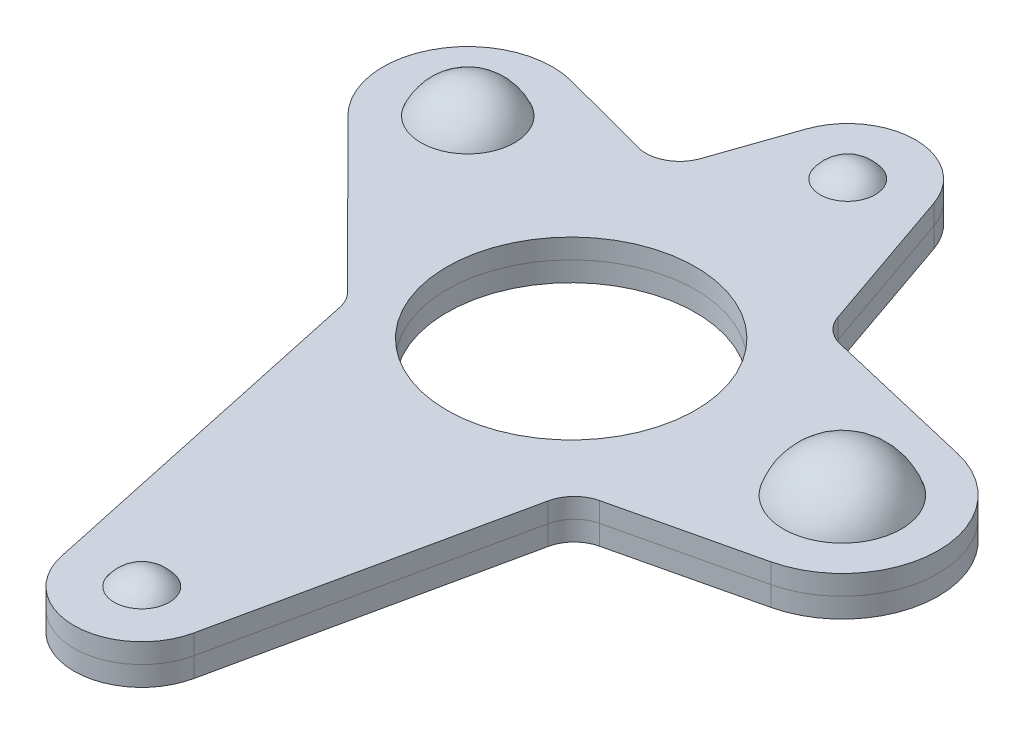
ISO-10303-21;
HEADER;
FILE_DESCRIPTION(('STEP AP214'),'2;1');
FILE_NAME('part.step','',(''),(''),'','','');
FILE_SCHEMA(('AUTOMOTIVE_DESIGN { 1 0 10303 214 1 1 1 1 }'));
ENDSEC;
DATA;
#1=APPLICATION_CONTEXT('core data for automotive mechanical design processes');
#2=APPLICATION_PROTOCOL_DEFINITION('international standard','automotive_design',2000,#1);
#3=PRODUCT_CONTEXT('',#1,'mechanical');
#4=PRODUCT('Part','Part','',(#3));
#5=PRODUCT_RELATED_PRODUCT_CATEGORY('part','',(#4));
#6=PRODUCT_DEFINITION_FORMATION('','',#4);
#7=PRODUCT_DEFINITION_CONTEXT('part definition',#1,'design');
#8=PRODUCT_DEFINITION('design','',#6,#7);
#9=PRODUCT_DEFINITION_SHAPE('','',#8);
#10=(LENGTH_UNIT() NAMED_UNIT(*) SI_UNIT(.MILLI.,.METRE.));
#11=(NAMED_UNIT(*) PLANE_ANGLE_UNIT() SI_UNIT($,.RADIAN.));
#12=(NAMED_UNIT(*) SI_UNIT($,.STERADIAN.) SOLID_ANGLE_UNIT());
#13=UNCERTAINTY_MEASURE_WITH_UNIT(LENGTH_MEASURE(1.E-05),#10,'distance_accuracy_value','');
#14=(GEOMETRIC_REPRESENTATION_CONTEXT(3) GLOBAL_UNCERTAINTY_ASSIGNED_CONTEXT((#13)) GLOBAL_UNIT_ASSIGNED_CONTEXT((#10,
#11,#12)) REPRESENTATION_CONTEXT('',''));
#15=CARTESIAN_POINT('',(0.,0.,0.));
#16=DIRECTION('',(0.,0.,1.));
#17=DIRECTION('',(1.,0.,0.));
#18=AXIS2_PLACEMENT_3D('',#15,#16,#17);
#19=CARTESIAN_POINT('',(0.,0.,0.));
#20=DIRECTION('',(0.,1.,0.));
#21=DIRECTION('',(0.,0.,1.));
#22=AXIS2_PLACEMENT_3D('',#19,#20,#21);
#23=PLANE('',#22);
#24=DIRECTION('',(-0.326901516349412,0.,-0.945058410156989));
#25=VECTOR('',#24,1.);
#26=CARTESIAN_POINT('',(5.67035046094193,0.,-26.4336112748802));
#27=LINE('',#26,#25);
#28=CARTESIAN_POINT('',(10.1711559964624,0.,-13.421973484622));
#29=VERTEX_POINT('',#28);
#30=CARTESIAN_POINT('',(5.67035046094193,0.,-26.4336112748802));
#31=VERTEX_POINT('',#30);
#32=EDGE_CURVE('E168',#29,#31,#27,.T.);
#33=ORIENTED_EDGE('',*,*,#32,.T.);
#34=CARTESIAN_POINT('',(0.,0.,-24.4722021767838));
#35=DIRECTION('',(0.,1.,0.));
#36=DIRECTION('',(0.,0.,1.));
#37=AXIS2_PLACEMENT_3D('',#34,#35,#36);
#38=CIRCLE('',#37,6.);
#39=CARTESIAN_POINT('',(-5.67035046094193,0.,-26.4336112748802));
#40=VERTEX_POINT('',#39);
#41=EDGE_CURVE('E176',#31,#40,#38,.T.);
#42=ORIENTED_EDGE('',*,*,#41,.T.);
#43=DIRECTION('',(-0.326901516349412,0.,0.945058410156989));
#44=VECTOR('',#43,1.);
#45=CARTESIAN_POINT('',(-5.67035046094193,0.,-26.4336112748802));
#46=LINE('',#45,#44);
#47=CARTESIAN_POINT('',(-8.06219095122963,0.,-19.5189019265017));
#48=VERTEX_POINT('',#47);
#49=EDGE_CURVE('E181',#40,#48,#46,.T.);
#50=ORIENTED_EDGE('',*,*,#49,.T.);
#51=CARTESIAN_POINT('',(-10.8973661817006,0.,-20.4996064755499));
#52=DIRECTION('',(0.,1.,0.));
#53=DIRECTION('',(0.,0.,1.));
#54=AXIS2_PLACEMENT_3D('',#51,#52,#53);
#55=CIRCLE('',#54,3.);
#56=CARTESIAN_POINT('',(-11.6702792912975,0.,-17.600881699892));
#57=VERTEX_POINT('',#56);
#58=EDGE_CURVE('E290',#48,#57,#55,.F.);
#59=ORIENTED_EDGE('',*,*,#58,.T.);
#60=DIRECTION('',(-0.966241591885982,0.,-0.257637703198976));
#61=VECTOR('',#60,1.);
#62=CARTESIAN_POINT('',(-19.7183523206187,0.,-19.7468119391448));
#63=LINE('',#62,#61);
#64=CARTESIAN_POINT('',(-19.7183523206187,0.,-19.7468119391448));
#65=VERTEX_POINT('',#64);
#66=EDGE_CURVE('E293',#57,#65,#63,.T.);
#67=ORIENTED_EDGE('',*,*,#66,.T.);
#68=CARTESIAN_POINT('',(-21.650635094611,0.,-12.4999999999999));
#69=DIRECTION('',(0.,1.,0.));
#70=DIRECTION('',(0.,0.,1.));
#71=AXIS2_PLACEMENT_3D('',#68,#69,#70);
#72=CIRCLE('',#71,7.5);
#73=CARTESIAN_POINT('',(-26.9604169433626,0.,-7.20318806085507));
#74=VERTEX_POINT('',#73);
#75=EDGE_CURVE('E296',#65,#74,#72,.T.);
#76=ORIENTED_EDGE('',*,*,#75,.T.);
#77=DIRECTION('',(0.706241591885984,0.,0.707970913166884));
#78=VECTOR('',#77,1.);
#79=CARTESIAN_POINT('',(-26.9604169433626,0.,-7.20318806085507));
#80=LINE('',#79,#78);
#81=CARTESIAN_POINT('',(-13.4425343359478,0.,6.34779478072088));
#82=VERTEX_POINT('',#81);
#83=EDGE_CURVE('E299',#74,#82,#80,.T.);
#84=ORIENTED_EDGE('',*,*,#83,.T.);
#85=CARTESIAN_POINT('',(-15.5664470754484,0.,8.46651955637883));
#86=DIRECTION('',(0.,1.,0.));
#87=DIRECTION('',(0.,0.,1.));
#88=AXIS2_PLACEMENT_3D('',#85,#86,#87);
#89=CIRCLE('',#88,3.);
#90=CARTESIAN_POINT('',(-12.6336825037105,0.,7.83494060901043));
#91=VERTEX_POINT('',#90);
#92=EDGE_CURVE('E302',#82,#91,#89,.F.);
#93=ORIENTED_EDGE('',*,*,#92,.T.);
#94=DIRECTION('',(0.210526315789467,0.,0.977588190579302));
#95=VECTOR('',#94,1.);
#96=CARTESIAN_POINT('',(-5.86552914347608,0.,39.2631578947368));
#97=LINE('',#96,#95);
#98=CARTESIAN_POINT('',(-5.86552914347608,0.,39.2631578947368));
#99=VERTEX_POINT('',#98);
#100=EDGE_CURVE('E305',#91,#99,#97,.T.);
#101=ORIENTED_EDGE('',*,*,#100,.T.);
#102=CARTESIAN_POINT('',(-2.63677968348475E-13,0.,38.));
#103=DIRECTION('',(0.,1.,0.));
#104=DIRECTION('',(0.,0.,1.));
#105=AXIS2_PLACEMENT_3D('',#102,#103,#104);
#106=CIRCLE('',#105,6.);
#107=CARTESIAN_POINT('',(5.86552914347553,0.,39.2631578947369));
#108=VERTEX_POINT('',#107);
#109=EDGE_CURVE('E308',#99,#108,#106,.T.);
#110=ORIENTED_EDGE('',*,*,#109,.T.);
#111=DIRECTION('',(0.210526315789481,0.,-0.977588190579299));
#112=VECTOR('',#111,1.);
#113=CARTESIAN_POINT('',(5.86552914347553,0.,39.2631578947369));
#114=LINE('',#113,#112);
#115=CARTESIAN_POINT('',(11.4237710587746,0.,13.4532175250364));
#116=VERTEX_POINT('',#115);
#117=EDGE_CURVE('E311',#108,#116,#114,.T.);
#118=ORIENTED_EDGE('',*,*,#117,.T.);
#119=CARTESIAN_POINT('',(14.3565356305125,0.,14.0847964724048));
#120=DIRECTION('',(0.,1.,0.));
#121=DIRECTION('',(0.,0.,1.));
#122=AXIS2_PLACEMENT_3D('',#119,#120,#121);
#123=CIRCLE('',#122,3.);
#124=CARTESIAN_POINT('',(13.6690356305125,0.,11.1646348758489));
#125=VERTEX_POINT('',#124);
#126=EDGE_CURVE('E314',#116,#125,#123,.F.);
#127=ORIENTED_EDGE('',*,*,#126,.T.);
#128=DIRECTION('',(0.973387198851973,0.,-0.229166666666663));
#129=VECTOR('',#128,1.);
#130=CARTESIAN_POINT('',(25.9479166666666,0.,8.27379119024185));
#131=LINE('',#130,#129);
#132=CARTESIAN_POINT('',(25.9479166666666,0.,8.27379119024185));
#133=VERTEX_POINT('',#132);
#134=EDGE_CURVE('E317',#125,#133,#131,.T.);
#135=ORIENTED_EDGE('',*,*,#134,.T.);
#136=CARTESIAN_POINT('',(24.,0.,0.));
#137=DIRECTION('',(0.,1.,0.));
#138=DIRECTION('',(0.,0.,1.));
#139=AXIS2_PLACEMENT_3D('',#136,#137,#138);
#140=CIRCLE('',#139,8.5);
#141=CARTESIAN_POINT('',(25.9479166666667,0.,-8.27379119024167));
#142=VERTEX_POINT('',#141);
#143=EDGE_CURVE('E320',#133,#142,#140,.T.);
#144=ORIENTED_EDGE('',*,*,#143,.T.);
#145=DIRECTION('',(-0.973387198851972,0.,-0.22916666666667));
#146=VECTOR('',#145,1.);
#147=CARTESIAN_POINT('',(25.9479166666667,0.,-8.27379119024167));
#148=LINE('',#147,#146);
#149=CARTESIAN_POINT('',(12.3188312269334,0.,-11.4825164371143));
#150=VERTEX_POINT('',#149);
#151=EDGE_CURVE('E190',#142,#150,#148,.T.);
#152=ORIENTED_EDGE('',*,*,#151,.T.);
#153=CARTESIAN_POINT('',(13.0063312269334,0.,-14.4026780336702));
#154=DIRECTION('',(0.,1.,0.));
#155=DIRECTION('',(0.,0.,1.));
#156=AXIS2_PLACEMENT_3D('',#153,#154,#155);
#157=CIRCLE('',#156,3.);
#158=EDGE_CURVE('E187',#150,#29,#157,.F.);
#159=ORIENTED_EDGE('',*,*,#158,.T.);
#160=EDGE_LOOP('',(#33,#42,#50,#59,#67,#76,#84,#93,#101,#110,#118,#127,#135,#144,#152,#159));
#161=FACE_BOUND('',#160,.T.);
#162=CARTESIAN_POINT('',(0.,0.,0.));
#163=DIRECTION('',(0.,1.,0.));
#164=DIRECTION('',(0.,0.,1.));
#165=AXIS2_PLACEMENT_3D('',#162,#163,#164);
#166=CIRCLE('',#165,11.);
#167=CARTESIAN_POINT('',(0.,0.,11.));
#168=VERTEX_POINT('',#167);
#169=EDGE_CURVE('E180',#168,#168,#166,.T.);
#170=ORIENTED_EDGE('',*,*,#169,.F.);
#171=EDGE_LOOP('',(#170));
#172=FACE_BOUND('',#171,.T.);
#173=CARTESIAN_POINT('',(24.,0.,0.));
#174=DIRECTION('',(0.,1.,0.));
#175=DIRECTION('',(0.,0.,1.));
#176=AXIS2_PLACEMENT_3D('',#173,#174,#175);
#177=CIRCLE('',#176,5.5);
#178=CARTESIAN_POINT('',(24.,0.,5.50000000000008));
#179=VERTEX_POINT('',#178);
#180=EDGE_CURVE('E193',#179,#179,#177,.F.);
#181=ORIENTED_EDGE('',*,*,#180,.T.);
#182=EDGE_LOOP('',(#181));
#183=FACE_BOUND('',#182,.T.);
#184=CARTESIAN_POINT('',(-21.650635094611,0.,-12.4999999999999));
#185=DIRECTION('',(0.,1.,0.));
#186=DIRECTION('',(0.,0.,1.));
#187=AXIS2_PLACEMENT_3D('',#184,#185,#186);
#188=CIRCLE('',#187,4.5);
#189=CARTESIAN_POINT('',(-21.650635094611,0.,-7.99999999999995));
#190=VERTEX_POINT('',#189);
#191=EDGE_CURVE('E203',#190,#190,#188,.T.);
#192=ORIENTED_EDGE('',*,*,#191,.F.);
#193=EDGE_LOOP('',(#192));
#194=FACE_BOUND('',#193,.T.);
#195=CARTESIAN_POINT('',(-2.65352581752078E-13,0.,38.));
#196=DIRECTION('',(0.,1.,0.));
#197=DIRECTION('',(0.,0.,1.));
#198=AXIS2_PLACEMENT_3D('',#195,#196,#197);
#199=CIRCLE('',#198,3.);
#200=CARTESIAN_POINT('',(-2.65352581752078E-13,0.,41.));
#201=VERTEX_POINT('',#200);
#202=EDGE_CURVE('E199',#201,#201,#199,.F.);
#203=ORIENTED_EDGE('',*,*,#202,.T.);
#204=EDGE_LOOP('',(#203));
#205=FACE_BOUND('',#204,.T.);
#206=CARTESIAN_POINT('',(0.,0.,-24.4722021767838));
#207=DIRECTION('',(0.,1.,0.));
#208=DIRECTION('',(0.,0.,1.));
#209=AXIS2_PLACEMENT_3D('',#206,#207,#208);
#210=CIRCLE('',#209,3.);
#211=CARTESIAN_POINT('',(0.,0.,-21.4722021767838));
#212=VERTEX_POINT('',#211);
#213=EDGE_CURVE('E188',#212,#212,#210,.F.);
#214=ORIENTED_EDGE('',*,*,#213,.T.);
#215=EDGE_LOOP('',(#214));
#216=FACE_BOUND('',#215,.T.);
#217=ADVANCED_FACE('F49',(#161,#172,#183,#194,#205,#216),#23,.T.);
#218=CARTESIAN_POINT('',(-5.67035046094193,1.75,-26.4336112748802));
#219=DIRECTION('',(0.945058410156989,0.,0.326901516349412));
#220=DIRECTION('',(0.326901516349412,0.,-0.945058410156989));
#221=AXIS2_PLACEMENT_3D('',#218,#219,#220);
#222=PLANE('',#221);
#223=ORIENTED_EDGE('',*,*,#49,.F.);
#224=DIRECTION('',(0.,-1.,0.));
#225=VECTOR('',#224,1.);
#226=CARTESIAN_POINT('',(-5.67035046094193,1.75,-26.4336112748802));
#227=LINE('',#226,#225);
#228=CARTESIAN_POINT('',(-5.67035046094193,-1.75,-26.4336112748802));
#229=VERTEX_POINT('',#228);
#230=EDGE_CURVE('E66',#40,#229,#227,.T.);
#231=ORIENTED_EDGE('',*,*,#230,.T.);
#232=DIRECTION('',(-0.326901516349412,0.,0.945058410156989));
#233=VECTOR('',#232,1.);
#234=CARTESIAN_POINT('',(-5.67035046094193,-1.75,-26.4336112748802));
#235=LINE('',#234,#233);
#236=CARTESIAN_POINT('',(-8.06219095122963,-1.75,-19.5189019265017));
#237=VERTEX_POINT('',#236);
#238=EDGE_CURVE('E279',#229,#237,#235,.T.);
#239=ORIENTED_EDGE('',*,*,#238,.T.);
#240=DIRECTION('',(0.,-1.,0.));
#241=VECTOR('',#240,1.);
#242=CARTESIAN_POINT('',(-8.06219095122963,1.75,-19.5189019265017));
#243=LINE('',#242,#241);
#244=EDGE_CURVE('E74',#48,#237,#243,.T.);
#245=ORIENTED_EDGE('',*,*,#244,.F.);
#246=EDGE_LOOP('',(#223,#231,#239,#245));
#247=FACE_BOUND('',#246,.T.);
#248=ADVANCED_FACE('F368',(#247),#222,.F.);
#249=CARTESIAN_POINT('',(-10.8973661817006,1.75,-20.4996064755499));
#250=DIRECTION('',(0.,-1.,0.));
#251=DIRECTION('',(0.,0.,-1.));
#252=AXIS2_PLACEMENT_3D('',#249,#250,#251);
#253=CYLINDRICAL_SURFACE('',#252,3.);
#254=ORIENTED_EDGE('',*,*,#58,.F.);
#255=ORIENTED_EDGE('',*,*,#244,.T.);
#256=CARTESIAN_POINT('',(-10.8973661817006,-1.75,-20.4996064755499));
#257=DIRECTION('',(0.,-1.,0.));
#258=DIRECTION('',(0.,0.,-1.));
#259=AXIS2_PLACEMENT_3D('',#256,#257,#258);
#260=CIRCLE('',#259,3.);
#261=CARTESIAN_POINT('',(-11.6702792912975,-1.75,-17.600881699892));
#262=VERTEX_POINT('',#261);
#263=EDGE_CURVE('E277',#237,#262,#260,.T.);
#264=ORIENTED_EDGE('',*,*,#263,.T.);
#265=DIRECTION('',(0.,-1.,0.));
#266=VECTOR('',#265,1.);
#267=CARTESIAN_POINT('',(-11.6702792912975,1.75,-17.600881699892));
#268=LINE('',#267,#266);
#269=EDGE_CURVE('E205',#57,#262,#268,.T.);
#270=ORIENTED_EDGE('',*,*,#269,.F.);
#271=EDGE_LOOP('',(#254,#255,#264,#270));
#272=FACE_BOUND('',#271,.T.);
#273=ADVANCED_FACE('F366',(#272),#253,.F.);
#274=CARTESIAN_POINT('',(-19.7183523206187,1.75,-19.7468119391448));
#275=DIRECTION('',(-0.257637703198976,0.,0.966241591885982));
#276=DIRECTION('',(0.966241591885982,0.,0.257637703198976));
#277=AXIS2_PLACEMENT_3D('',#274,#275,#276);
#278=PLANE('',#277);
#279=ORIENTED_EDGE('',*,*,#66,.F.);
#280=ORIENTED_EDGE('',*,*,#269,.T.);
#281=DIRECTION('',(-0.966241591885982,0.,-0.257637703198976));
#282=VECTOR('',#281,1.);
#283=CARTESIAN_POINT('',(-19.7183523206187,-1.75,-19.7468119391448));
#284=LINE('',#283,#282);
#285=CARTESIAN_POINT('',(-19.7183523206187,-1.75,-19.7468119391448));
#286=VERTEX_POINT('',#285);
#287=EDGE_CURVE('E274',#262,#286,#284,.T.);
#288=ORIENTED_EDGE('',*,*,#287,.T.);
#289=DIRECTION('',(0.,-1.,0.));
#290=VECTOR('',#289,1.);
#291=CARTESIAN_POINT('',(-19.7183523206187,1.75,-19.7468119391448));
#292=LINE('',#291,#290);
#293=EDGE_CURVE('E207',#65,#286,#292,.T.);
#294=ORIENTED_EDGE('',*,*,#293,.F.);
#295=EDGE_LOOP('',(#279,#280,#288,#294));
#296=FACE_BOUND('',#295,.T.);
#297=ADVANCED_FACE('F365',(#296),#278,.F.);
#298=CARTESIAN_POINT('',(-21.650635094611,1.75,-12.4999999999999));
#299=DIRECTION('',(0.,-1.,0.));
#300=DIRECTION('',(0.,0.,-1.));
#301=AXIS2_PLACEMENT_3D('',#298,#299,#300);
#302=CYLINDRICAL_SURFACE('',#301,7.5);
#303=ORIENTED_EDGE('',*,*,#75,.F.);
#304=ORIENTED_EDGE('',*,*,#293,.T.);
#305=CARTESIAN_POINT('',(-21.650635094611,-1.75,-12.4999999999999));
#306=DIRECTION('',(0.,1.,0.));
#307=DIRECTION('',(0.,0.,1.));
#308=AXIS2_PLACEMENT_3D('',#305,#306,#307);
#309=CIRCLE('',#308,7.5);
#310=CARTESIAN_POINT('',(-26.9604169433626,-1.75,-7.20318806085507));
#311=VERTEX_POINT('',#310);
#312=EDGE_CURVE('E271',#286,#311,#309,.T.);
#313=ORIENTED_EDGE('',*,*,#312,.T.);
#314=DIRECTION('',(0.,-1.,0.));
#315=VECTOR('',#314,1.);
#316=CARTESIAN_POINT('',(-26.9604169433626,1.75,-7.20318806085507));
#317=LINE('',#316,#315);
#318=EDGE_CURVE('E209',#74,#311,#317,.T.);
#319=ORIENTED_EDGE('',*,*,#318,.F.);
#320=EDGE_LOOP('',(#303,#304,#313,#319));
#321=FACE_BOUND('',#320,.T.);
#322=ADVANCED_FACE('F360',(#321),#302,.T.);
#323=CARTESIAN_POINT('',(-26.9604169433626,1.75,-7.20318806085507));
#324=DIRECTION('',(0.707970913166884,0.,-0.706241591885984));
#325=DIRECTION('',(-0.706241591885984,0.,-0.707970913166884));
#326=AXIS2_PLACEMENT_3D('',#323,#324,#325);
#327=PLANE('',#326);
#328=ORIENTED_EDGE('',*,*,#83,.F.);
#329=ORIENTED_EDGE('',*,*,#318,.T.);
#330=DIRECTION('',(0.706241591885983,0.,0.707970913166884));
#331=VECTOR('',#330,1.);
#332=CARTESIAN_POINT('',(-26.9604169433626,-1.75,-7.20318806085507));
#333=LINE('',#332,#331);
#334=CARTESIAN_POINT('',(-13.4425343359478,-1.75,6.34779478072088));
#335=VERTEX_POINT('',#334);
#336=EDGE_CURVE('E268',#311,#335,#333,.T.);
#337=ORIENTED_EDGE('',*,*,#336,.T.);
#338=DIRECTION('',(0.,-1.,0.));
#339=VECTOR('',#338,1.);
#340=CARTESIAN_POINT('',(-13.4425343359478,1.75,6.34779478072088));
#341=LINE('',#340,#339);
#342=EDGE_CURVE('E211',#82,#335,#341,.T.);
#343=ORIENTED_EDGE('',*,*,#342,.F.);
#344=EDGE_LOOP('',(#328,#329,#337,#343));
#345=FACE_BOUND('',#344,.T.);
#346=ADVANCED_FACE('F357',(#345),#327,.F.);
#347=CARTESIAN_POINT('',(-15.5664470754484,1.75,8.46651955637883));
#348=DIRECTION('',(0.,-1.,0.));
#349=DIRECTION('',(0.,0.,-1.));
#350=AXIS2_PLACEMENT_3D('',#347,#348,#349);
#351=CYLINDRICAL_SURFACE('',#350,3.);
#352=ORIENTED_EDGE('',*,*,#92,.F.);
#353=ORIENTED_EDGE('',*,*,#342,.T.);
#354=CARTESIAN_POINT('',(-15.5664470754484,-1.75,8.46651955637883));
#355=DIRECTION('',(0.,-1.,0.));
#356=DIRECTION('',(0.,0.,-1.));
#357=AXIS2_PLACEMENT_3D('',#354,#355,#356);
#358=CIRCLE('',#357,3.);
#359=CARTESIAN_POINT('',(-12.6336825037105,-1.75,7.83494060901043));
#360=VERTEX_POINT('',#359);
#361=EDGE_CURVE('E265',#335,#360,#358,.T.);
#362=ORIENTED_EDGE('',*,*,#361,.T.);
#363=DIRECTION('',(0.,-1.,0.));
#364=VECTOR('',#363,1.);
#365=CARTESIAN_POINT('',(-12.6336825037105,1.75,7.83494060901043));
#366=LINE('',#365,#364);
#367=EDGE_CURVE('E213',#91,#360,#366,.T.);
#368=ORIENTED_EDGE('',*,*,#367,.F.);
#369=EDGE_LOOP('',(#352,#353,#362,#368));
#370=FACE_BOUND('',#369,.T.);
#371=ADVANCED_FACE('F354',(#370),#351,.F.);
#372=CARTESIAN_POINT('',(-5.86552914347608,1.75,39.2631578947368));
#373=DIRECTION('',(0.977588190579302,0.,-0.210526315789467));
#374=DIRECTION('',(-0.210526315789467,0.,-0.977588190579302));
#375=AXIS2_PLACEMENT_3D('',#372,#373,#374);
#376=PLANE('',#375);
#377=ORIENTED_EDGE('',*,*,#100,.F.);
#378=ORIENTED_EDGE('',*,*,#367,.T.);
#379=DIRECTION('',(0.210526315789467,0.,0.977588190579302));
#380=VECTOR('',#379,1.);
#381=CARTESIAN_POINT('',(-5.86552914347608,-1.75,39.2631578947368));
#382=LINE('',#381,#380);
#383=CARTESIAN_POINT('',(-5.86552914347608,-1.75,39.2631578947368));
#384=VERTEX_POINT('',#383);
#385=EDGE_CURVE('E262',#360,#384,#382,.T.);
#386=ORIENTED_EDGE('',*,*,#385,.T.);
#387=DIRECTION('',(0.,-1.,0.));
#388=VECTOR('',#387,1.);
#389=CARTESIAN_POINT('',(-5.86552914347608,1.75,39.2631578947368));
#390=LINE('',#389,#388);
#391=EDGE_CURVE('E215',#99,#384,#390,.T.);
#392=ORIENTED_EDGE('',*,*,#391,.F.);
#393=EDGE_LOOP('',(#377,#378,#386,#392));
#394=FACE_BOUND('',#393,.T.);
#395=ADVANCED_FACE('F348',(#394),#376,.F.);
#396=CARTESIAN_POINT('',(-2.63677968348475E-13,1.75,38.));
#397=DIRECTION('',(0.,-1.,0.));
#398=DIRECTION('',(0.,0.,-1.));
#399=AXIS2_PLACEMENT_3D('',#396,#397,#398);
#400=CYLINDRICAL_SURFACE('',#399,6.);
#401=ORIENTED_EDGE('',*,*,#109,.F.);
#402=ORIENTED_EDGE('',*,*,#391,.T.);
#403=CARTESIAN_POINT('',(-2.63677968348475E-13,-1.75,38.));
#404=DIRECTION('',(0.,1.,0.));
#405=DIRECTION('',(0.,0.,1.));
#406=AXIS2_PLACEMENT_3D('',#403,#404,#405);
#407=CIRCLE('',#406,6.);
#408=CARTESIAN_POINT('',(5.86552914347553,-1.75,39.2631578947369));
#409=VERTEX_POINT('',#408);
#410=EDGE_CURVE('E259',#384,#409,#407,.T.);
#411=ORIENTED_EDGE('',*,*,#410,.T.);
#412=DIRECTION('',(0.,-1.,0.));
#413=VECTOR('',#412,1.);
#414=CARTESIAN_POINT('',(5.86552914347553,1.75,39.2631578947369));
#415=LINE('',#414,#413);
#416=EDGE_CURVE('E217',#108,#409,#415,.T.);
#417=ORIENTED_EDGE('',*,*,#416,.F.);
#418=EDGE_LOOP('',(#401,#402,#411,#417));
#419=FACE_BOUND('',#418,.T.);
#420=ADVANCED_FACE('F345',(#419),#400,.T.);
#421=CARTESIAN_POINT('',(5.86552914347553,1.75,39.2631578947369));
#422=DIRECTION('',(-0.977588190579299,0.,-0.210526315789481));
#423=DIRECTION('',(-0.210526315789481,0.,0.977588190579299));
#424=AXIS2_PLACEMENT_3D('',#421,#422,#423);
#425=PLANE('',#424);
#426=ORIENTED_EDGE('',*,*,#117,.F.);
#427=ORIENTED_EDGE('',*,*,#416,.T.);
#428=DIRECTION('',(0.210526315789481,0.,-0.977588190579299));
#429=VECTOR('',#428,1.);
#430=CARTESIAN_POINT('',(5.86552914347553,-1.75,39.2631578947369));
#431=LINE('',#430,#429);
#432=CARTESIAN_POINT('',(11.4237710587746,-1.75,13.4532175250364));
#433=VERTEX_POINT('',#432);
#434=EDGE_CURVE('E256',#409,#433,#431,.T.);
#435=ORIENTED_EDGE('',*,*,#434,.T.);
#436=DIRECTION('',(0.,-1.,0.));
#437=VECTOR('',#436,1.);
#438=CARTESIAN_POINT('',(11.4237710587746,1.75,13.4532175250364));
#439=LINE('',#438,#437);
#440=EDGE_CURVE('E219',#116,#433,#439,.T.);
#441=ORIENTED_EDGE('',*,*,#440,.F.);
#442=EDGE_LOOP('',(#426,#427,#435,#441));
#443=FACE_BOUND('',#442,.T.);
#444=ADVANCED_FACE('F342',(#443),#425,.F.);
#445=CARTESIAN_POINT('',(14.3565356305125,1.75,14.0847964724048));
#446=DIRECTION('',(0.,-1.,0.));
#447=DIRECTION('',(0.,0.,-1.));
#448=AXIS2_PLACEMENT_3D('',#445,#446,#447);
#449=CYLINDRICAL_SURFACE('',#448,3.);
#450=ORIENTED_EDGE('',*,*,#126,.F.);
#451=ORIENTED_EDGE('',*,*,#440,.T.);
#452=CARTESIAN_POINT('',(14.3565356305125,-1.75,14.0847964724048));
#453=DIRECTION('',(0.,-1.,0.));
#454=DIRECTION('',(0.,0.,-1.));
#455=AXIS2_PLACEMENT_3D('',#452,#453,#454);
#456=CIRCLE('',#455,3.);
#457=CARTESIAN_POINT('',(13.6690356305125,-1.75,11.1646348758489));
#458=VERTEX_POINT('',#457);
#459=EDGE_CURVE('E253',#433,#458,#456,.T.);
#460=ORIENTED_EDGE('',*,*,#459,.T.);
#461=DIRECTION('',(0.,-1.,0.));
#462=VECTOR('',#461,1.);
#463=CARTESIAN_POINT('',(13.6690356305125,1.75,11.1646348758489));
#464=LINE('',#463,#462);
#465=EDGE_CURVE('E221',#125,#458,#464,.T.);
#466=ORIENTED_EDGE('',*,*,#465,.F.);
#467=EDGE_LOOP('',(#450,#451,#460,#466));
#468=FACE_BOUND('',#467,.T.);
#469=ADVANCED_FACE('F336',(#468),#449,.F.);
#470=CARTESIAN_POINT('',(25.9479166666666,1.75,8.27379119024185));
#471=DIRECTION('',(-0.229166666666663,0.,-0.973387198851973));
#472=DIRECTION('',(-0.973387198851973,0.,0.229166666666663));
#473=AXIS2_PLACEMENT_3D('',#470,#471,#472);
#474=PLANE('',#473);
#475=ORIENTED_EDGE('',*,*,#134,.F.);
#476=ORIENTED_EDGE('',*,*,#465,.T.);
#477=DIRECTION('',(0.973387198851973,0.,-0.229166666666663));
#478=VECTOR('',#477,1.);
#479=CARTESIAN_POINT('',(25.9479166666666,-1.75,8.27379119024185));
#480=LINE('',#479,#478);
#481=CARTESIAN_POINT('',(25.9479166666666,-1.75,8.27379119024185));
#482=VERTEX_POINT('',#481);
#483=EDGE_CURVE('E250',#458,#482,#480,.T.);
#484=ORIENTED_EDGE('',*,*,#483,.T.);
#485=DIRECTION('',(0.,-1.,0.));
#486=VECTOR('',#485,1.);
#487=CARTESIAN_POINT('',(25.9479166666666,1.75,8.27379119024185));
#488=LINE('',#487,#486);
#489=EDGE_CURVE('E223',#133,#482,#488,.T.);
#490=ORIENTED_EDGE('',*,*,#489,.F.);
#491=EDGE_LOOP('',(#475,#476,#484,#490));
#492=FACE_BOUND('',#491,.T.);
#493=ADVANCED_FACE('F333',(#492),#474,.F.);
#494=CARTESIAN_POINT('',(24.,1.75,0.));
#495=DIRECTION('',(0.,-1.,0.));
#496=DIRECTION('',(0.,0.,-1.));
#497=AXIS2_PLACEMENT_3D('',#494,#495,#496);
#498=CYLINDRICAL_SURFACE('',#497,8.5);
#499=ORIENTED_EDGE('',*,*,#143,.F.);
#500=ORIENTED_EDGE('',*,*,#489,.T.);
#501=CARTESIAN_POINT('',(24.,-1.75,0.));
#502=DIRECTION('',(0.,1.,0.));
#503=DIRECTION('',(0.,0.,1.));
#504=AXIS2_PLACEMENT_3D('',#501,#502,#503);
#505=CIRCLE('',#504,8.5);
#506=CARTESIAN_POINT('',(25.9479166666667,-1.75,-8.27379119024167));
#507=VERTEX_POINT('',#506);
#508=EDGE_CURVE('E247',#482,#507,#505,.T.);
#509=ORIENTED_EDGE('',*,*,#508,.T.);
#510=DIRECTION('',(0.,-1.,0.));
#511=VECTOR('',#510,1.);
#512=CARTESIAN_POINT('',(25.9479166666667,1.75,-8.27379119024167));
#513=LINE('',#512,#511);
#514=EDGE_CURVE('E225',#142,#507,#513,.T.);
#515=ORIENTED_EDGE('',*,*,#514,.F.);
#516=EDGE_LOOP('',(#499,#500,#509,#515));
#517=FACE_BOUND('',#516,.T.);
#518=ADVANCED_FACE('F330',(#517),#498,.T.);
#519=CARTESIAN_POINT('',(25.9479166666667,1.75,-8.27379119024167));
#520=DIRECTION('',(-0.22916666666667,0.,0.973387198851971));
#521=DIRECTION('',(0.973387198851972,0.,0.22916666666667));
#522=AXIS2_PLACEMENT_3D('',#519,#520,#521);
#523=PLANE('',#522);
#524=ORIENTED_EDGE('',*,*,#151,.F.);
#525=ORIENTED_EDGE('',*,*,#514,.T.);
#526=DIRECTION('',(-0.973387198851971,0.,-0.22916666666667));
#527=VECTOR('',#526,1.);
#528=CARTESIAN_POINT('',(25.9479166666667,-1.75,-8.27379119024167));
#529=LINE('',#528,#527);
#530=CARTESIAN_POINT('',(12.3188312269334,-1.75,-11.4825164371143));
#531=VERTEX_POINT('',#530);
#532=EDGE_CURVE('E236',#507,#531,#529,.T.);
#533=ORIENTED_EDGE('',*,*,#532,.T.);
#534=DIRECTION('',(0.,-1.,0.));
#535=VECTOR('',#534,1.);
#536=CARTESIAN_POINT('',(12.3188312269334,1.75,-11.4825164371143));
#537=LINE('',#536,#535);
#538=EDGE_CURVE('E227',#150,#531,#537,.T.);
#539=ORIENTED_EDGE('',*,*,#538,.F.);
#540=EDGE_LOOP('',(#524,#525,#533,#539));
#541=FACE_BOUND('',#540,.T.);
#542=ADVANCED_FACE('F325',(#541),#523,.F.);
#543=CARTESIAN_POINT('',(0.,1.75,-24.4722021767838));
#544=DIRECTION('',(0.,-1.,0.));
#545=DIRECTION('',(0.,0.,-1.));
#546=AXIS2_PLACEMENT_3D('',#543,#544,#545);
#547=CYLINDRICAL_SURFACE('',#546,6.);
#548=ORIENTED_EDGE('',*,*,#41,.F.);
#549=DIRECTION('',(0.,-1.,0.));
#550=VECTOR('',#549,1.);
#551=CARTESIAN_POINT('',(5.67035046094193,1.75,-26.4336112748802));
#552=LINE('',#551,#550);
#553=CARTESIAN_POINT('',(5.67035046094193,-1.75,-26.4336112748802));
#554=VERTEX_POINT('',#553);
#555=EDGE_CURVE('E53',#31,#554,#552,.T.);
#556=ORIENTED_EDGE('',*,*,#555,.T.);
#557=CARTESIAN_POINT('',(0.,-1.75,-24.4722021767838));
#558=DIRECTION('',(0.,1.,0.));
#559=DIRECTION('',(0.,0.,1.));
#560=AXIS2_PLACEMENT_3D('',#557,#558,#559);
#561=CIRCLE('',#560,6.);
#562=EDGE_CURVE('E240',#554,#229,#561,.T.);
#563=ORIENTED_EDGE('',*,*,#562,.T.);
#564=ORIENTED_EDGE('',*,*,#230,.F.);
#565=EDGE_LOOP('',(#548,#556,#563,#564));
#566=FACE_BOUND('',#565,.T.);
#567=ADVANCED_FACE('F177',(#566),#547,.T.);
#568=CARTESIAN_POINT('',(0.,-1.75,-24.4722021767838));
#569=DIRECTION('',(0.,1.,0.));
#570=DIRECTION('',(0.,0.,1.));
#571=AXIS2_PLACEMENT_3D('',#568,#569,#570);
#572=PLANE('',#571);
#573=CARTESIAN_POINT('',(-21.650635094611,-1.75,-12.4999999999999));
#574=DIRECTION('',(0.,1.,0.));
#575=DIRECTION('',(0.,0.,1.));
#576=AXIS2_PLACEMENT_3D('',#573,#574,#575);
#577=CIRCLE('',#576,4.14578098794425);
#578=CARTESIAN_POINT('',(-21.650635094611,-1.75,-8.3542190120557));
#579=VERTEX_POINT('',#578);
#580=EDGE_CURVE('E13',#579,#579,#577,.F.);
#581=ORIENTED_EDGE('',*,*,#580,.F.);
#582=EDGE_LOOP('',(#581));
#583=FACE_BOUND('',#582,.T.);
#584=CARTESIAN_POINT('',(-2.65352581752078E-13,-1.75,38.));
#585=DIRECTION('',(0.,1.,0.));
#586=DIRECTION('',(0.,0.,1.));
#587=AXIS2_PLACEMENT_3D('',#584,#585,#586);
#588=CIRCLE('',#587,2.43669858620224);
#589=CARTESIAN_POINT('',(-2.65352581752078E-13,-1.75,40.4366985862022));
#590=VERTEX_POINT('',#589);
#591=EDGE_CURVE('E58',#590,#590,#588,.T.);
#592=ORIENTED_EDGE('',*,*,#591,.T.);
#593=EDGE_LOOP('',(#592));
#594=FACE_BOUND('',#593,.T.);
#595=CARTESIAN_POINT('',(24.,-1.75,0.));
#596=DIRECTION('',(0.,1.,0.));
#597=DIRECTION('',(0.,0.,1.));
#598=AXIS2_PLACEMENT_3D('',#595,#596,#597);
#599=CIRCLE('',#598,5.21416340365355);
#600=CARTESIAN_POINT('',(24.,-1.75,5.21416340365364));
#601=VERTEX_POINT('',#600);
#602=EDGE_CURVE('E446',#601,#601,#599,.T.);
#603=ORIENTED_EDGE('',*,*,#602,.T.);
#604=EDGE_LOOP('',(#603));
#605=FACE_BOUND('',#604,.T.);
#606=CARTESIAN_POINT('',(0.,-1.75,-24.4722021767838));
#607=DIRECTION('',(0.,1.,0.));
#608=DIRECTION('',(0.,0.,1.));
#609=AXIS2_PLACEMENT_3D('',#606,#607,#608);
#610=CIRCLE('',#609,2.43669858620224);
#611=CARTESIAN_POINT('',(0.,-1.75,-22.0355035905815));
#612=VERTEX_POINT('',#611);
#613=EDGE_CURVE('E243',#612,#612,#610,.T.);
#614=ORIENTED_EDGE('',*,*,#613,.T.);
#615=EDGE_LOOP('',(#614));
#616=FACE_BOUND('',#615,.T.);
#617=ORIENTED_EDGE('',*,*,#562,.F.);
#618=DIRECTION('',(-0.326901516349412,0.,-0.945058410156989));
#619=VECTOR('',#618,1.);
#620=CARTESIAN_POINT('',(5.67035046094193,-1.75,-26.4336112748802));
#621=LINE('',#620,#619);
#622=CARTESIAN_POINT('',(10.1711559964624,-1.75,-13.421973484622));
#623=VERTEX_POINT('',#622);
#624=EDGE_CURVE('E170',#623,#554,#621,.T.);
#625=ORIENTED_EDGE('',*,*,#624,.F.);
#626=CARTESIAN_POINT('',(13.0063312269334,-1.75,-14.4026780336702));
#627=DIRECTION('',(0.,-1.,0.));
#628=DIRECTION('',(0.,0.,-1.));
#629=AXIS2_PLACEMENT_3D('',#626,#627,#628);
#630=CIRCLE('',#629,3.);
#631=EDGE_CURVE('E231',#531,#623,#630,.T.);
#632=ORIENTED_EDGE('',*,*,#631,.F.);
#633=ORIENTED_EDGE('',*,*,#532,.F.);
#634=ORIENTED_EDGE('',*,*,#508,.F.);
#635=ORIENTED_EDGE('',*,*,#483,.F.);
#636=ORIENTED_EDGE('',*,*,#459,.F.);
#637=ORIENTED_EDGE('',*,*,#434,.F.);
#638=ORIENTED_EDGE('',*,*,#410,.F.);
#639=ORIENTED_EDGE('',*,*,#385,.F.);
#640=ORIENTED_EDGE('',*,*,#361,.F.);
#641=ORIENTED_EDGE('',*,*,#336,.F.);
#642=ORIENTED_EDGE('',*,*,#312,.F.);
#643=ORIENTED_EDGE('',*,*,#287,.F.);
#644=ORIENTED_EDGE('',*,*,#263,.F.);
#645=ORIENTED_EDGE('',*,*,#238,.F.);
#646=EDGE_LOOP('',(#617,#625,#632,#633,#634,#635,#636,#637,#638,#639,#640,#641,#642,#643,#644,#645));
#647=FACE_BOUND('',#646,.T.);
#648=CARTESIAN_POINT('',(0.,-1.75,0.));
#649=DIRECTION('',(0.,1.,0.));
#650=DIRECTION('',(0.,0.,1.));
#651=AXIS2_PLACEMENT_3D('',#648,#649,#650);
#652=CIRCLE('',#651,11.);
#653=CARTESIAN_POINT('',(0.,-1.75,11.));
#654=VERTEX_POINT('',#653);
#655=EDGE_CURVE('E282',#654,#654,#652,.T.);
#656=ORIENTED_EDGE('',*,*,#655,.T.);
#657=EDGE_LOOP('',(#656));
#658=FACE_BOUND('',#657,.T.);
#659=ADVANCED_FACE('F238',(#583,#594,#605,#616,#647,#658),#572,.F.);
#660=CARTESIAN_POINT('',(-21.650635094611,0.,-12.4999999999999));
#661=DIRECTION('',(0.86602540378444,0.,0.499999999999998));
#662=DIRECTION('',(-0.499999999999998,0.,0.86602540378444));
#663=AXIS2_PLACEMENT_3D('',#660,#661,#662);
#664=SPHERICAL_SURFACE('',#663,4.5);
#665=CARTESIAN_POINT('',(-21.650635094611,0.,-12.4999999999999));
#666=DIRECTION('',(0.,1.,0.));
#667=DIRECTION('',(0.,0.,1.));
#668=AXIS2_PLACEMENT_3D('',#665,#666,#667);
#669=SPHERICAL_SURFACE('',#668,4.5);
#670=ORIENTED_EDGE('',*,*,#580,.T.);
#671=EDGE_LOOP('',(#670));
#672=FACE_BOUND('',#671,.T.);
#673=ORIENTED_EDGE('',*,*,#191,.T.);
#674=EDGE_LOOP('',(#673));
#675=FACE_BOUND('',#674,.T.);
#676=ADVANCED_FACE('F51',(#672,#675),#669,.F.);
#677=CARTESIAN_POINT('',(-2.65352581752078E-13,0.,38.));
#678=DIRECTION('',(0.,0.,-1.));
#679=DIRECTION('',(-1.,0.,0.));
#680=AXIS2_PLACEMENT_3D('',#677,#678,#679);
#681=SPHERICAL_SURFACE('',#680,3.);
#682=CARTESIAN_POINT('',(-2.65352581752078E-13,0.,38.));
#683=DIRECTION('',(0.,1.,0.));
#684=DIRECTION('',(0.,0.,1.));
#685=AXIS2_PLACEMENT_3D('',#682,#683,#684);
#686=SPHERICAL_SURFACE('',#685,3.);
#687=ORIENTED_EDGE('',*,*,#591,.F.);
#688=EDGE_LOOP('',(#687));
#689=FACE_BOUND('',#688,.T.);
#690=ORIENTED_EDGE('',*,*,#202,.F.);
#691=EDGE_LOOP('',(#690));
#692=FACE_BOUND('',#691,.T.);
#693=ADVANCED_FACE('F412',(#689,#692),#686,.F.);
#694=CARTESIAN_POINT('',(24.,0.,0.));
#695=DIRECTION('',(-1.,0.,0.));
#696=DIRECTION('',(0.,0.,-1.));
#697=AXIS2_PLACEMENT_3D('',#694,#695,#696);
#698=SPHERICAL_SURFACE('',#697,5.5);
#699=CARTESIAN_POINT('',(24.,0.,0.));
#700=DIRECTION('',(0.,1.,0.));
#701=DIRECTION('',(0.,0.,1.));
#702=AXIS2_PLACEMENT_3D('',#699,#700,#701);
#703=SPHERICAL_SURFACE('',#702,5.5);
#704=ORIENTED_EDGE('',*,*,#602,.F.);
#705=EDGE_LOOP('',(#704));
#706=FACE_BOUND('',#705,.T.);
#707=ORIENTED_EDGE('',*,*,#180,.F.);
#708=EDGE_LOOP('',(#707));
#709=FACE_BOUND('',#708,.T.);
#710=ADVANCED_FACE('F409',(#706,#709),#703,.F.);
#711=CARTESIAN_POINT('',(0.,0.,-24.4722021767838));
#712=DIRECTION('',(0.,0.,1.));
#713=DIRECTION('',(1.,0.,0.));
#714=AXIS2_PLACEMENT_3D('',#711,#712,#713);
#715=SPHERICAL_SURFACE('',#714,3.);
#716=CARTESIAN_POINT('',(0.,0.,-24.4722021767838));
#717=DIRECTION('',(0.,1.,0.));
#718=DIRECTION('',(0.,0.,1.));
#719=AXIS2_PLACEMENT_3D('',#716,#717,#718);
#720=SPHERICAL_SURFACE('',#719,3.);
#721=ORIENTED_EDGE('',*,*,#613,.F.);
#722=EDGE_LOOP('',(#721));
#723=FACE_BOUND('',#722,.T.);
#724=ORIENTED_EDGE('',*,*,#213,.F.);
#725=EDGE_LOOP('',(#724));
#726=FACE_BOUND('',#725,.T.);
#727=ADVANCED_FACE('F405',(#723,#726),#720,.F.);
#728=CARTESIAN_POINT('',(0.,1.75,0.));
#729=DIRECTION('',(0.,-1.,0.));
#730=DIRECTION('',(0.,0.,-1.));
#731=AXIS2_PLACEMENT_3D('',#728,#729,#730);
#732=CYLINDRICAL_SURFACE('',#731,11.);
#733=ORIENTED_EDGE('',*,*,#655,.F.);
#734=EDGE_LOOP('',(#733));
#735=FACE_BOUND('',#734,.T.);
#736=ORIENTED_EDGE('',*,*,#169,.T.);
#737=EDGE_LOOP('',(#736));
#738=FACE_BOUND('',#737,.T.);
#739=ADVANCED_FACE('F400',(#735,#738),#732,.F.);
#740=CARTESIAN_POINT('',(13.0063312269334,1.75,-14.4026780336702));
#741=DIRECTION('',(0.,-1.,0.));
#742=DIRECTION('',(0.,0.,-1.));
#743=AXIS2_PLACEMENT_3D('',#740,#741,#742);
#744=CYLINDRICAL_SURFACE('',#743,3.);
#745=ORIENTED_EDGE('',*,*,#158,.F.);
#746=ORIENTED_EDGE('',*,*,#538,.T.);
#747=ORIENTED_EDGE('',*,*,#631,.T.);
#748=DIRECTION('',(0.,-1.,0.));
#749=VECTOR('',#748,1.);
#750=CARTESIAN_POINT('',(10.1711559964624,1.75,-13.421973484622));
#751=LINE('',#750,#749);
#752=EDGE_CURVE('E174',#29,#623,#751,.T.);
#753=ORIENTED_EDGE('',*,*,#752,.F.);
#754=EDGE_LOOP('',(#745,#746,#747,#753));
#755=FACE_BOUND('',#754,.T.);
#756=ADVANCED_FACE('F232',(#755),#744,.F.);
#757=CARTESIAN_POINT('',(5.67035046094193,1.75,-26.4336112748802));
#758=DIRECTION('',(-0.945058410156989,0.,0.326901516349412));
#759=DIRECTION('',(0.326901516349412,0.,0.945058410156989));
#760=AXIS2_PLACEMENT_3D('',#757,#758,#759);
#761=PLANE('',#760);
#762=ORIENTED_EDGE('',*,*,#32,.F.);
#763=ORIENTED_EDGE('',*,*,#752,.T.);
#764=ORIENTED_EDGE('',*,*,#624,.T.);
#765=ORIENTED_EDGE('',*,*,#555,.F.);
#766=EDGE_LOOP('',(#762,#763,#764,#765));
#767=FACE_BOUND('',#766,.T.);
#768=ADVANCED_FACE('F166',(#767),#761,.F.);
#769=CLOSED_SHELL('',(#217,#248,#273,#297,#322,#346,#371,#395,#420,#444,#469,#493,#518,#542,
#567,#659,#676,#693,#710,#727,#739,#756,#768));
#770=MANIFOLD_SOLID_BREP('B2',#769);
#771=CARTESIAN_POINT('',(0.,0.,0.));
#772=DIRECTION('',(0.,1.,0.));
#773=DIRECTION('',(0.,0.,1.));
#774=AXIS2_PLACEMENT_3D('',#771,#772,#773);
#775=PLANE('',#774);
#776=CARTESIAN_POINT('',(0.,0.,-24.4722021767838));
#777=DIRECTION('',(0.,1.,0.));
#778=DIRECTION('',(0.,0.,1.));
#779=AXIS2_PLACEMENT_3D('',#776,#777,#778);
#780=CIRCLE('',#779,3.);
#781=CARTESIAN_POINT('',(0.,0.,-21.4722021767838));
#782=VERTEX_POINT('',#781);
#783=EDGE_CURVE('E753',#782,#782,#780,.F.);
#784=ORIENTED_EDGE('',*,*,#783,.F.);
#785=EDGE_LOOP('',(#784));
#786=FACE_BOUND('',#785,.T.);
#787=CARTESIAN_POINT('',(-2.65352581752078E-13,0.,38.));
#788=DIRECTION('',(0.,1.,0.));
#789=DIRECTION('',(0.,0.,1.));
#790=AXIS2_PLACEMENT_3D('',#787,#788,#789);
#791=CIRCLE('',#790,3.);
#792=CARTESIAN_POINT('',(-2.65352581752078E-13,0.,41.));
#793=VERTEX_POINT('',#792);
#794=EDGE_CURVE('E742',#793,#793,#791,.F.);
#795=ORIENTED_EDGE('',*,*,#794,.F.);
#796=EDGE_LOOP('',(#795));
#797=FACE_BOUND('',#796,.T.);
#798=CARTESIAN_POINT('',(-21.650635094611,0.,-12.4999999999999));
#799=DIRECTION('',(0.,1.,0.));
#800=DIRECTION('',(0.,0.,1.));
#801=AXIS2_PLACEMENT_3D('',#798,#799,#800);
#802=CIRCLE('',#801,4.5);
#803=CARTESIAN_POINT('',(-21.650635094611,0.,-7.99999999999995));
#804=VERTEX_POINT('',#803);
#805=EDGE_CURVE('E47',#804,#804,#802,.T.);
#806=ORIENTED_EDGE('',*,*,#805,.T.);
#807=EDGE_LOOP('',(#806));
#808=FACE_BOUND('',#807,.T.);
#809=CARTESIAN_POINT('',(24.,0.,0.));
#810=DIRECTION('',(0.,1.,0.));
#811=DIRECTION('',(0.,0.,1.));
#812=AXIS2_PLACEMENT_3D('',#809,#810,#811);
#813=CIRCLE('',#812,5.5);
#814=CARTESIAN_POINT('',(24.,0.,5.50000000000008));
#815=VERTEX_POINT('',#814);
#816=EDGE_CURVE('E745',#815,#815,#813,.F.);
#817=ORIENTED_EDGE('',*,*,#816,.F.);
#818=EDGE_LOOP('',(#817));
#819=FACE_BOUND('',#818,.T.);
#820=CARTESIAN_POINT('',(0.,0.,0.));
#821=DIRECTION('',(0.,1.,0.));
#822=DIRECTION('',(0.,0.,1.));
#823=AXIS2_PLACEMENT_3D('',#820,#821,#822);
#824=CIRCLE('',#823,11.);
#825=CARTESIAN_POINT('',(0.,0.,11.));
#826=VERTEX_POINT('',#825);
#827=EDGE_CURVE('E618',#826,#826,#824,.T.);
#828=ORIENTED_EDGE('',*,*,#827,.T.);
#829=EDGE_LOOP('',(#828));
#830=FACE_BOUND('',#829,.T.);
#831=DIRECTION('',(-0.326901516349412,0.,-0.945058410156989));
#832=VECTOR('',#831,1.);
#833=CARTESIAN_POINT('',(5.67035046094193,0.,-26.4336112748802));
#834=LINE('',#833,#832);
#835=CARTESIAN_POINT('',(10.1711559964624,0.,-13.421973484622));
#836=VERTEX_POINT('',#835);
#837=CARTESIAN_POINT('',(5.67035046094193,0.,-26.4336112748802));
#838=VERTEX_POINT('',#837);
#839=EDGE_CURVE('E756',#836,#838,#834,.T.);
#840=ORIENTED_EDGE('',*,*,#839,.F.);
#841=CARTESIAN_POINT('',(13.0063312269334,0.,-14.4026780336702));
#842=DIRECTION('',(0.,1.,0.));
#843=DIRECTION('',(0.,0.,1.));
#844=AXIS2_PLACEMENT_3D('',#841,#842,#843);
#845=CIRCLE('',#844,3.);
#846=CARTESIAN_POINT('',(12.3188312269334,0.,-11.4825164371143));
#847=VERTEX_POINT('',#846);
#848=EDGE_CURVE('E761',#847,#836,#845,.F.);
#849=ORIENTED_EDGE('',*,*,#848,.F.);
#850=DIRECTION('',(-0.973387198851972,0.,-0.22916666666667));
#851=VECTOR('',#850,1.);
#852=CARTESIAN_POINT('',(25.9479166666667,0.,-8.27379119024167));
#853=LINE('',#852,#851);
#854=CARTESIAN_POINT('',(25.9479166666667,0.,-8.27379119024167));
#855=VERTEX_POINT('',#854);
#856=EDGE_CURVE('E763',#855,#847,#853,.T.);
#857=ORIENTED_EDGE('',*,*,#856,.F.);
#858=CARTESIAN_POINT('',(24.,0.,0.));
#859=DIRECTION('',(0.,1.,0.));
#860=DIRECTION('',(0.,0.,1.));
#861=AXIS2_PLACEMENT_3D('',#858,#859,#860);
#862=CIRCLE('',#861,8.5);
#863=CARTESIAN_POINT('',(25.9479166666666,0.,8.27379119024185));
#864=VERTEX_POINT('',#863);
#865=EDGE_CURVE('E765',#864,#855,#862,.T.);
#866=ORIENTED_EDGE('',*,*,#865,.F.);
#867=DIRECTION('',(0.973387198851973,0.,-0.229166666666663));
#868=VECTOR('',#867,1.);
#869=CARTESIAN_POINT('',(25.9479166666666,0.,8.27379119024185));
#870=LINE('',#869,#868);
#871=CARTESIAN_POINT('',(13.6690356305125,0.,11.1646348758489));
#872=VERTEX_POINT('',#871);
#873=EDGE_CURVE('E767',#872,#864,#870,.T.);
#874=ORIENTED_EDGE('',*,*,#873,.F.);
#875=CARTESIAN_POINT('',(14.3565356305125,0.,14.0847964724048));
#876=DIRECTION('',(0.,1.,0.));
#877=DIRECTION('',(0.,0.,1.));
#878=AXIS2_PLACEMENT_3D('',#875,#876,#877);
#879=CIRCLE('',#878,3.);
#880=CARTESIAN_POINT('',(11.4237710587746,0.,13.4532175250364));
#881=VERTEX_POINT('',#880);
#882=EDGE_CURVE('E769',#881,#872,#879,.F.);
#883=ORIENTED_EDGE('',*,*,#882,.F.);
#884=DIRECTION('',(0.210526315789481,0.,-0.977588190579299));
#885=VECTOR('',#884,1.);
#886=CARTESIAN_POINT('',(5.86552914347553,0.,39.2631578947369));
#887=LINE('',#886,#885);
#888=CARTESIAN_POINT('',(5.86552914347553,0.,39.2631578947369));
#889=VERTEX_POINT('',#888);
#890=EDGE_CURVE('E771',#889,#881,#887,.T.);
#891=ORIENTED_EDGE('',*,*,#890,.F.);
#892=CARTESIAN_POINT('',(-2.63677968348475E-13,0.,38.));
#893=DIRECTION('',(0.,1.,0.));
#894=DIRECTION('',(0.,0.,1.));
#895=AXIS2_PLACEMENT_3D('',#892,#893,#894);
#896=CIRCLE('',#895,6.);
#897=CARTESIAN_POINT('',(-5.86552914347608,0.,39.2631578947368));
#898=VERTEX_POINT('',#897);
#899=EDGE_CURVE('E773',#898,#889,#896,.T.);
#900=ORIENTED_EDGE('',*,*,#899,.F.);
#901=DIRECTION('',(0.210526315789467,0.,0.977588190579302));
#902=VECTOR('',#901,1.);
#903=CARTESIAN_POINT('',(-5.86552914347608,0.,39.2631578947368));
#904=LINE('',#903,#902);
#905=CARTESIAN_POINT('',(-12.6336825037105,0.,7.83494060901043));
#906=VERTEX_POINT('',#905);
#907=EDGE_CURVE('E775',#906,#898,#904,.T.);
#908=ORIENTED_EDGE('',*,*,#907,.F.);
#909=CARTESIAN_POINT('',(-15.5664470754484,0.,8.46651955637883));
#910=DIRECTION('',(0.,1.,0.));
#911=DIRECTION('',(0.,0.,1.));
#912=AXIS2_PLACEMENT_3D('',#909,#910,#911);
#913=CIRCLE('',#912,3.);
#914=CARTESIAN_POINT('',(-13.4425343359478,0.,6.34779478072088));
#915=VERTEX_POINT('',#914);
#916=EDGE_CURVE('E777',#915,#906,#913,.F.);
#917=ORIENTED_EDGE('',*,*,#916,.F.);
#918=DIRECTION('',(0.706241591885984,0.,0.707970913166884));
#919=VECTOR('',#918,1.);
#920=CARTESIAN_POINT('',(-26.9604169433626,0.,-7.20318806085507));
#921=LINE('',#920,#919);
#922=CARTESIAN_POINT('',(-26.9604169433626,0.,-7.20318806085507));
#923=VERTEX_POINT('',#922);
#924=EDGE_CURVE('E779',#923,#915,#921,.T.);
#925=ORIENTED_EDGE('',*,*,#924,.F.);
#926=CARTESIAN_POINT('',(-21.650635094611,0.,-12.4999999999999));
#927=DIRECTION('',(0.,1.,0.));
#928=DIRECTION('',(0.,0.,1.));
#929=AXIS2_PLACEMENT_3D('',#926,#927,#928);
#930=CIRCLE('',#929,7.5);
#931=CARTESIAN_POINT('',(-19.7183523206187,0.,-19.7468119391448));
#932=VERTEX_POINT('',#931);
#933=EDGE_CURVE('E781',#932,#923,#930,.T.);
#934=ORIENTED_EDGE('',*,*,#933,.F.);
#935=DIRECTION('',(-0.966241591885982,0.,-0.257637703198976));
#936=VECTOR('',#935,1.);
#937=CARTESIAN_POINT('',(-19.7183523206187,0.,-19.7468119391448));
#938=LINE('',#937,#936);
#939=CARTESIAN_POINT('',(-11.6702792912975,0.,-17.600881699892));
#940=VERTEX_POINT('',#939);
#941=EDGE_CURVE('E783',#940,#932,#938,.T.);
#942=ORIENTED_EDGE('',*,*,#941,.F.);
#943=CARTESIAN_POINT('',(-10.8973661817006,0.,-20.4996064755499));
#944=DIRECTION('',(0.,1.,0.));
#945=DIRECTION('',(0.,0.,1.));
#946=AXIS2_PLACEMENT_3D('',#943,#944,#945);
#947=CIRCLE('',#946,3.);
#948=CARTESIAN_POINT('',(-8.06219095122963,0.,-19.5189019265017));
#949=VERTEX_POINT('',#948);
#950=EDGE_CURVE('E785',#949,#940,#947,.F.);
#951=ORIENTED_EDGE('',*,*,#950,.F.);
#952=DIRECTION('',(-0.326901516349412,0.,0.945058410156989));
#953=VECTOR('',#952,1.);
#954=CARTESIAN_POINT('',(-5.67035046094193,0.,-26.4336112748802));
#955=LINE('',#954,#953);
#956=CARTESIAN_POINT('',(-5.67035046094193,0.,-26.4336112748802));
#957=VERTEX_POINT('',#956);
#958=EDGE_CURVE('E632',#957,#949,#955,.T.);
#959=ORIENTED_EDGE('',*,*,#958,.F.);
#960=CARTESIAN_POINT('',(0.,0.,-24.4722021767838));
#961=DIRECTION('',(0.,1.,0.));
#962=DIRECTION('',(0.,0.,1.));
#963=AXIS2_PLACEMENT_3D('',#960,#961,#962);
#964=CIRCLE('',#963,6.);
#965=EDGE_CURVE('E613',#838,#957,#964,.T.);
#966=ORIENTED_EDGE('',*,*,#965,.F.);
#967=EDGE_LOOP('',(#840,#849,#857,#866,#874,#883,#891,#900,#908,#917,#925,#934,#942,#951,#959,#966));
#968=FACE_BOUND('',#967,.T.);
#969=ADVANCED_FACE('F610',(#786,#797,#808,#819,#830,#968),#775,.F.);
#970=CARTESIAN_POINT('',(0.,1.75,-24.4722021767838));
#971=DIRECTION('',(0.,1.,0.));
#972=DIRECTION('',(0.,0.,1.));
#973=AXIS2_PLACEMENT_3D('',#970,#971,#972);
#974=PLANE('',#973);
#975=CARTESIAN_POINT('',(-21.650635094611,1.75,-12.4999999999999));
#976=DIRECTION('',(0.,1.,0.));
#977=DIRECTION('',(0.,0.,1.));
#978=AXIS2_PLACEMENT_3D('',#975,#976,#977);
#979=CIRCLE('',#978,4.14578098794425);
#980=CARTESIAN_POINT('',(-21.650635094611,1.75,-8.3542190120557));
#981=VERTEX_POINT('',#980);
#982=EDGE_CURVE('E875',#981,#981,#979,.F.);
#983=ORIENTED_EDGE('',*,*,#982,.T.);
#984=EDGE_LOOP('',(#983));
#985=FACE_BOUND('',#984,.T.);
#986=CARTESIAN_POINT('',(-2.65352581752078E-13,1.75,38.));
#987=DIRECTION('',(0.,1.,0.));
#988=DIRECTION('',(0.,0.,1.));
#989=AXIS2_PLACEMENT_3D('',#986,#987,#988);
#990=CIRCLE('',#989,2.43669858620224);
#991=CARTESIAN_POINT('',(-2.65352581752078E-13,1.75,40.4366985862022));
#992=VERTEX_POINT('',#991);
#993=EDGE_CURVE('E872',#992,#992,#990,.T.);
#994=ORIENTED_EDGE('',*,*,#993,.F.);
#995=EDGE_LOOP('',(#994));
#996=FACE_BOUND('',#995,.T.);
#997=CARTESIAN_POINT('',(24.,1.75,0.));
#998=DIRECTION('',(0.,1.,0.));
#999=DIRECTION('',(0.,0.,1.));
#1000=AXIS2_PLACEMENT_3D('',#997,#998,#999);
#1001=CIRCLE('',#1000,5.21416340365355);
#1002=CARTESIAN_POINT('',(24.,1.75,5.21416340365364));
#1003=VERTEX_POINT('',#1002);
#1004=EDGE_CURVE('E869',#1003,#1003,#1001,.T.);
#1005=ORIENTED_EDGE('',*,*,#1004,.F.);
#1006=EDGE_LOOP('',(#1005));
#1007=FACE_BOUND('',#1006,.T.);
#1008=CARTESIAN_POINT('',(0.,1.75,-24.4722021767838));
#1009=DIRECTION('',(0.,1.,0.));
#1010=DIRECTION('',(0.,0.,1.));
#1011=AXIS2_PLACEMENT_3D('',#1008,#1009,#1010);
#1012=CIRCLE('',#1011,2.43669858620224);
#1013=CARTESIAN_POINT('',(0.,1.75,-22.0355035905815));
#1014=VERTEX_POINT('',#1013);
#1015=EDGE_CURVE('E866',#1014,#1014,#1012,.T.);
#1016=ORIENTED_EDGE('',*,*,#1015,.F.);
#1017=EDGE_LOOP('',(#1016));
#1018=FACE_BOUND('',#1017,.T.);
#1019=CARTESIAN_POINT('',(0.,1.75,-24.4722021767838));
#1020=DIRECTION('',(0.,1.,0.));
#1021=DIRECTION('',(0.,0.,1.));
#1022=AXIS2_PLACEMENT_3D('',#1019,#1020,#1021);
#1023=CIRCLE('',#1022,6.);
#1024=CARTESIAN_POINT('',(5.67035046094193,1.75,-26.4336112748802));
#1025=VERTEX_POINT('',#1024);
#1026=CARTESIAN_POINT('',(-5.67035046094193,1.75,-26.4336112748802));
#1027=VERTEX_POINT('',#1026);
#1028=EDGE_CURVE('E731',#1025,#1027,#1023,.T.);
#1029=ORIENTED_EDGE('',*,*,#1028,.T.);
#1030=DIRECTION('',(-0.326901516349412,0.,0.945058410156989));
#1031=VECTOR('',#1030,1.);
#1032=CARTESIAN_POINT('',(-5.67035046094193,1.75,-26.4336112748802));
#1033=LINE('',#1032,#1031);
#1034=CARTESIAN_POINT('',(-8.06219095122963,1.75,-19.5189019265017));
#1035=VERTEX_POINT('',#1034);
#1036=EDGE_CURVE('E722',#1027,#1035,#1033,.T.);
#1037=ORIENTED_EDGE('',*,*,#1036,.T.);
#1038=CARTESIAN_POINT('',(-10.8973661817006,1.75,-20.4996064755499));
#1039=DIRECTION('',(0.,-1.,0.));
#1040=DIRECTION('',(0.,0.,-1.));
#1041=AXIS2_PLACEMENT_3D('',#1038,#1039,#1040);
#1042=CIRCLE('',#1041,3.);
#1043=CARTESIAN_POINT('',(-11.6702792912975,1.75,-17.600881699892));
#1044=VERTEX_POINT('',#1043);
#1045=EDGE_CURVE('E730',#1035,#1044,#1042,.T.);
#1046=ORIENTED_EDGE('',*,*,#1045,.T.);
#1047=DIRECTION('',(-0.966241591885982,0.,-0.257637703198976));
#1048=VECTOR('',#1047,1.);
#1049=CARTESIAN_POINT('',(-19.7183523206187,1.75,-19.7468119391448));
#1050=LINE('',#1049,#1048);
#1051=CARTESIAN_POINT('',(-19.7183523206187,1.75,-19.7468119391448));
#1052=VERTEX_POINT('',#1051);
#1053=EDGE_CURVE('E800',#1044,#1052,#1050,.T.);
#1054=ORIENTED_EDGE('',*,*,#1053,.T.);
#1055=CARTESIAN_POINT('',(-21.650635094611,1.75,-12.4999999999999));
#1056=DIRECTION('',(0.,1.,0.));
#1057=DIRECTION('',(0.,0.,1.));
#1058=AXIS2_PLACEMENT_3D('',#1055,#1056,#1057);
#1059=CIRCLE('',#1058,7.5);
#1060=CARTESIAN_POINT('',(-26.9604169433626,1.75,-7.20318806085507));
#1061=VERTEX_POINT('',#1060);
#1062=EDGE_CURVE('E860',#1052,#1061,#1059,.T.);
#1063=ORIENTED_EDGE('',*,*,#1062,.T.);
#1064=DIRECTION('',(0.706241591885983,0.,0.707970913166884));
#1065=VECTOR('',#1064,1.);
#1066=CARTESIAN_POINT('',(-26.9604169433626,1.75,-7.20318806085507));
#1067=LINE('',#1066,#1065);
#1068=CARTESIAN_POINT('',(-13.4425343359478,1.75,6.34779478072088));
#1069=VERTEX_POINT('',#1068);
#1070=EDGE_CURVE('E858',#1061,#1069,#1067,.T.);
#1071=ORIENTED_EDGE('',*,*,#1070,.T.);
#1072=CARTESIAN_POINT('',(-15.5664470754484,1.75,8.46651955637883));
#1073=DIRECTION('',(0.,-1.,0.));
#1074=DIRECTION('',(0.,0.,-1.));
#1075=AXIS2_PLACEMENT_3D('',#1072,#1073,#1074);
#1076=CIRCLE('',#1075,3.);
#1077=CARTESIAN_POINT('',(-12.6336825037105,1.75,7.83494060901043));
#1078=VERTEX_POINT('',#1077);
#1079=EDGE_CURVE('E856',#1069,#1078,#1076,.T.);
#1080=ORIENTED_EDGE('',*,*,#1079,.T.);
#1081=DIRECTION('',(0.210526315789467,0.,0.977588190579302));
#1082=VECTOR('',#1081,1.);
#1083=CARTESIAN_POINT('',(-5.86552914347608,1.75,39.2631578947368));
#1084=LINE('',#1083,#1082);
#1085=CARTESIAN_POINT('',(-5.86552914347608,1.75,39.2631578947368));
#1086=VERTEX_POINT('',#1085);
#1087=EDGE_CURVE('E854',#1078,#1086,#1084,.T.);
#1088=ORIENTED_EDGE('',*,*,#1087,.T.);
#1089=CARTESIAN_POINT('',(-2.63677968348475E-13,1.75,38.));
#1090=DIRECTION('',(0.,1.,0.));
#1091=DIRECTION('',(0.,0.,1.));
#1092=AXIS2_PLACEMENT_3D('',#1089,#1090,#1091);
#1093=CIRCLE('',#1092,6.);
#1094=CARTESIAN_POINT('',(5.86552914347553,1.75,39.2631578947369));
#1095=VERTEX_POINT('',#1094);
#1096=EDGE_CURVE('E852',#1086,#1095,#1093,.T.);
#1097=ORIENTED_EDGE('',*,*,#1096,.T.);
#1098=DIRECTION('',(0.210526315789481,0.,-0.977588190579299));
#1099=VECTOR('',#1098,1.);
#1100=CARTESIAN_POINT('',(5.86552914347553,1.75,39.2631578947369));
#1101=LINE('',#1100,#1099);
#1102=CARTESIAN_POINT('',(11.4237710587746,1.75,13.4532175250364));
#1103=VERTEX_POINT('',#1102);
#1104=EDGE_CURVE('E850',#1095,#1103,#1101,.T.);
#1105=ORIENTED_EDGE('',*,*,#1104,.T.);
#1106=CARTESIAN_POINT('',(14.3565356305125,1.75,14.0847964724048));
#1107=DIRECTION('',(0.,-1.,0.));
#1108=DIRECTION('',(0.,0.,-1.));
#1109=AXIS2_PLACEMENT_3D('',#1106,#1107,#1108);
#1110=CIRCLE('',#1109,3.);
#1111=CARTESIAN_POINT('',(13.6690356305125,1.75,11.1646348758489));
#1112=VERTEX_POINT('',#1111);
#1113=EDGE_CURVE('E848',#1103,#1112,#1110,.T.);
#1114=ORIENTED_EDGE('',*,*,#1113,.T.);
#1115=DIRECTION('',(0.973387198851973,0.,-0.229166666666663));
#1116=VECTOR('',#1115,1.);
#1117=CARTESIAN_POINT('',(25.9479166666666,1.75,8.27379119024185));
#1118=LINE('',#1117,#1116);
#1119=CARTESIAN_POINT('',(25.9479166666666,1.75,8.27379119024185));
#1120=VERTEX_POINT('',#1119);
#1121=EDGE_CURVE('E846',#1112,#1120,#1118,.T.);
#1122=ORIENTED_EDGE('',*,*,#1121,.T.);
#1123=CARTESIAN_POINT('',(24.,1.75,0.));
#1124=DIRECTION('',(0.,1.,0.));
#1125=DIRECTION('',(0.,0.,1.));
#1126=AXIS2_PLACEMENT_3D('',#1123,#1124,#1125);
#1127=CIRCLE('',#1126,8.5);
#1128=CARTESIAN_POINT('',(25.9479166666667,1.75,-8.27379119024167));
#1129=VERTEX_POINT('',#1128);
#1130=EDGE_CURVE('E844',#1120,#1129,#1127,.T.);
#1131=ORIENTED_EDGE('',*,*,#1130,.T.);
#1132=DIRECTION('',(-0.973387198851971,0.,-0.22916666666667));
#1133=VECTOR('',#1132,1.);
#1134=CARTESIAN_POINT('',(25.9479166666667,1.75,-8.27379119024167));
#1135=LINE('',#1134,#1133);
#1136=CARTESIAN_POINT('',(12.3188312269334,1.75,-11.4825164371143));
#1137=VERTEX_POINT('',#1136);
#1138=EDGE_CURVE('E842',#1129,#1137,#1135,.T.);
#1139=ORIENTED_EDGE('',*,*,#1138,.T.);
#1140=CARTESIAN_POINT('',(13.0063312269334,1.75,-14.4026780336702));
#1141=DIRECTION('',(0.,-1.,0.));
#1142=DIRECTION('',(0.,0.,-1.));
#1143=AXIS2_PLACEMENT_3D('',#1140,#1141,#1142);
#1144=CIRCLE('',#1143,3.);
#1145=CARTESIAN_POINT('',(10.1711559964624,1.75,-13.421973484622));
#1146=VERTEX_POINT('',#1145);
#1147=EDGE_CURVE('E840',#1137,#1146,#1144,.T.);
#1148=ORIENTED_EDGE('',*,*,#1147,.T.);
#1149=DIRECTION('',(-0.326901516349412,0.,-0.945058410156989));
#1150=VECTOR('',#1149,1.);
#1151=CARTESIAN_POINT('',(5.67035046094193,1.75,-26.4336112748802));
#1152=LINE('',#1151,#1150);
#1153=EDGE_CURVE('E737',#1146,#1025,#1152,.T.);
#1154=ORIENTED_EDGE('',*,*,#1153,.T.);
#1155=EDGE_LOOP('',(#1029,#1037,#1046,#1054,#1063,#1071,#1080,#1088,#1097,#1105,#1114,#1122,
#1131,#1139,#1148,#1154));
#1156=FACE_BOUND('',#1155,.T.);
#1157=CARTESIAN_POINT('',(0.,1.75,0.));
#1158=DIRECTION('',(0.,1.,0.));
#1159=DIRECTION('',(0.,0.,1.));
#1160=AXIS2_PLACEMENT_3D('',#1157,#1158,#1159);
#1161=CIRCLE('',#1160,11.);
#1162=CARTESIAN_POINT('',(0.,1.75,11.));
#1163=VERTEX_POINT('',#1162);
#1164=EDGE_CURVE('E739',#1163,#1163,#1161,.T.);
#1165=ORIENTED_EDGE('',*,*,#1164,.F.);
#1166=EDGE_LOOP('',(#1165));
#1167=FACE_BOUND('',#1166,.T.);
#1168=ADVANCED_FACE('F734',(#985,#996,#1007,#1018,#1156,#1167),#974,.T.);
#1169=CARTESIAN_POINT('',(0.,1.75,-24.4722021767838));
#1170=DIRECTION('',(0.,-1.,0.));
#1171=DIRECTION('',(0.,0.,-1.));
#1172=AXIS2_PLACEMENT_3D('',#1169,#1170,#1171);
#1173=CYLINDRICAL_SURFACE('',#1172,6.);
#1174=DIRECTION('',(0.,-1.,0.));
#1175=VECTOR('',#1174,1.);
#1176=CARTESIAN_POINT('',(5.67035046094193,1.75,-26.4336112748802));
#1177=LINE('',#1176,#1175);
#1178=EDGE_CURVE('E837',#1025,#838,#1177,.T.);
#1179=ORIENTED_EDGE('',*,*,#1178,.T.);
#1180=ORIENTED_EDGE('',*,*,#965,.T.);
#1181=DIRECTION('',(0.,-1.,0.));
#1182=VECTOR('',#1181,1.);
#1183=CARTESIAN_POINT('',(-5.67035046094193,1.75,-26.4336112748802));
#1184=LINE('',#1183,#1182);
#1185=EDGE_CURVE('E725',#1027,#957,#1184,.T.);
#1186=ORIENTED_EDGE('',*,*,#1185,.F.);
#1187=ORIENTED_EDGE('',*,*,#1028,.F.);
#1188=EDGE_LOOP('',(#1179,#1180,#1186,#1187));
#1189=FACE_BOUND('',#1188,.T.);
#1190=ADVANCED_FACE('F741',(#1189),#1173,.T.);
#1191=CARTESIAN_POINT('',(-5.67035046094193,1.75,-26.4336112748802));
#1192=DIRECTION('',(0.945058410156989,0.,0.326901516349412));
#1193=DIRECTION('',(0.326901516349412,0.,-0.945058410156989));
#1194=AXIS2_PLACEMENT_3D('',#1191,#1192,#1193);
#1195=PLANE('',#1194);
#1196=ORIENTED_EDGE('',*,*,#1185,.T.);
#1197=ORIENTED_EDGE('',*,*,#958,.T.);
#1198=DIRECTION('',(0.,-1.,0.));
#1199=VECTOR('',#1198,1.);
#1200=CARTESIAN_POINT('',(-8.06219095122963,1.75,-19.5189019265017));
#1201=LINE('',#1200,#1199);
#1202=EDGE_CURVE('E727',#1035,#949,#1201,.T.);
#1203=ORIENTED_EDGE('',*,*,#1202,.F.);
#1204=ORIENTED_EDGE('',*,*,#1036,.F.);
#1205=EDGE_LOOP('',(#1196,#1197,#1203,#1204));
#1206=FACE_BOUND('',#1205,.T.);
#1207=ADVANCED_FACE('F724',(#1206),#1195,.F.);
#1208=CARTESIAN_POINT('',(-10.8973661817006,1.75,-20.4996064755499));
#1209=DIRECTION('',(0.,-1.,0.));
#1210=DIRECTION('',(0.,0.,-1.));
#1211=AXIS2_PLACEMENT_3D('',#1208,#1209,#1210);
#1212=CYLINDRICAL_SURFACE('',#1211,3.);
#1213=ORIENTED_EDGE('',*,*,#1202,.T.);
#1214=ORIENTED_EDGE('',*,*,#950,.T.);
#1215=DIRECTION('',(0.,-1.,0.));
#1216=VECTOR('',#1215,1.);
#1217=CARTESIAN_POINT('',(-11.6702792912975,1.75,-17.600881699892));
#1218=LINE('',#1217,#1216);
#1219=EDGE_CURVE('E747',#1044,#940,#1218,.T.);
#1220=ORIENTED_EDGE('',*,*,#1219,.F.);
#1221=ORIENTED_EDGE('',*,*,#1045,.F.);
#1222=EDGE_LOOP('',(#1213,#1214,#1220,#1221));
#1223=FACE_BOUND('',#1222,.T.);
#1224=ADVANCED_FACE('F789',(#1223),#1212,.F.);
#1225=CARTESIAN_POINT('',(-19.7183523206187,1.75,-19.7468119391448));
#1226=DIRECTION('',(-0.257637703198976,0.,0.966241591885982));
#1227=DIRECTION('',(0.966241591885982,0.,0.257637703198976));
#1228=AXIS2_PLACEMENT_3D('',#1225,#1226,#1227);
#1229=PLANE('',#1228);
#1230=ORIENTED_EDGE('',*,*,#1219,.T.);
#1231=ORIENTED_EDGE('',*,*,#941,.T.);
#1232=DIRECTION('',(0.,-1.,0.));
#1233=VECTOR('',#1232,1.);
#1234=CARTESIAN_POINT('',(-19.7183523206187,1.75,-19.7468119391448));
#1235=LINE('',#1234,#1233);
#1236=EDGE_CURVE('E801',#1052,#932,#1235,.T.);
#1237=ORIENTED_EDGE('',*,*,#1236,.F.);
#1238=ORIENTED_EDGE('',*,*,#1053,.F.);
#1239=EDGE_LOOP('',(#1230,#1231,#1237,#1238));
#1240=FACE_BOUND('',#1239,.T.);
#1241=ADVANCED_FACE('F799',(#1240),#1229,.F.);
#1242=CARTESIAN_POINT('',(-21.650635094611,1.75,-12.4999999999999));
#1243=DIRECTION('',(0.,-1.,0.));
#1244=DIRECTION('',(0.,0.,-1.));
#1245=AXIS2_PLACEMENT_3D('',#1242,#1243,#1244);
#1246=CYLINDRICAL_SURFACE('',#1245,7.5);
#1247=ORIENTED_EDGE('',*,*,#1236,.T.);
#1248=ORIENTED_EDGE('',*,*,#933,.T.);
#1249=DIRECTION('',(0.,-1.,0.));
#1250=VECTOR('',#1249,1.);
#1251=CARTESIAN_POINT('',(-26.9604169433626,1.75,-7.20318806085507));
#1252=LINE('',#1251,#1250);
#1253=EDGE_CURVE('E802',#1061,#923,#1252,.T.);
#1254=ORIENTED_EDGE('',*,*,#1253,.F.);
#1255=ORIENTED_EDGE('',*,*,#1062,.F.);
#1256=EDGE_LOOP('',(#1247,#1248,#1254,#1255));
#1257=FACE_BOUND('',#1256,.T.);
#1258=ADVANCED_FACE('F964',(#1257),#1246,.T.);
#1259=CARTESIAN_POINT('',(-26.9604169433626,1.75,-7.20318806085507));
#1260=DIRECTION('',(0.707970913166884,0.,-0.706241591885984));
#1261=DIRECTION('',(-0.706241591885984,0.,-0.707970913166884));
#1262=AXIS2_PLACEMENT_3D('',#1259,#1260,#1261);
#1263=PLANE('',#1262);
#1264=ORIENTED_EDGE('',*,*,#1253,.T.);
#1265=ORIENTED_EDGE('',*,*,#924,.T.);
#1266=DIRECTION('',(0.,-1.,0.));
#1267=VECTOR('',#1266,1.);
#1268=CARTESIAN_POINT('',(-13.4425343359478,1.75,6.34779478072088));
#1269=LINE('',#1268,#1267);
#1270=EDGE_CURVE('E807',#1069,#915,#1269,.T.);
#1271=ORIENTED_EDGE('',*,*,#1270,.F.);
#1272=ORIENTED_EDGE('',*,*,#1070,.F.);
#1273=EDGE_LOOP('',(#1264,#1265,#1271,#1272));
#1274=FACE_BOUND('',#1273,.T.);
#1275=ADVANCED_FACE('F960',(#1274),#1263,.F.);
#1276=CARTESIAN_POINT('',(-15.5664470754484,1.75,8.46651955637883));
#1277=DIRECTION('',(0.,-1.,0.));
#1278=DIRECTION('',(0.,0.,-1.));
#1279=AXIS2_PLACEMENT_3D('',#1276,#1277,#1278);
#1280=CYLINDRICAL_SURFACE('',#1279,3.);
#1281=ORIENTED_EDGE('',*,*,#1270,.T.);
#1282=ORIENTED_EDGE('',*,*,#916,.T.);
#1283=DIRECTION('',(0.,-1.,0.));
#1284=VECTOR('',#1283,1.);
#1285=CARTESIAN_POINT('',(-12.6336825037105,1.75,7.83494060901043));
#1286=LINE('',#1285,#1284);
#1287=EDGE_CURVE('E810',#1078,#906,#1286,.T.);
#1288=ORIENTED_EDGE('',*,*,#1287,.F.);
#1289=ORIENTED_EDGE('',*,*,#1079,.F.);
#1290=EDGE_LOOP('',(#1281,#1282,#1288,#1289));
#1291=FACE_BOUND('',#1290,.T.);
#1292=ADVANCED_FACE('F956',(#1291),#1280,.F.);
#1293=CARTESIAN_POINT('',(-5.86552914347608,1.75,39.2631578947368));
#1294=DIRECTION('',(0.977588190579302,0.,-0.210526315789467));
#1295=DIRECTION('',(-0.210526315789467,0.,-0.977588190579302));
#1296=AXIS2_PLACEMENT_3D('',#1293,#1294,#1295);
#1297=PLANE('',#1296);
#1298=ORIENTED_EDGE('',*,*,#1287,.T.);
#1299=ORIENTED_EDGE('',*,*,#907,.T.);
#1300=DIRECTION('',(0.,-1.,0.));
#1301=VECTOR('',#1300,1.);
#1302=CARTESIAN_POINT('',(-5.86552914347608,1.75,39.2631578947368));
#1303=LINE('',#1302,#1301);
#1304=EDGE_CURVE('E813',#1086,#898,#1303,.T.);
#1305=ORIENTED_EDGE('',*,*,#1304,.F.);
#1306=ORIENTED_EDGE('',*,*,#1087,.F.);
#1307=EDGE_LOOP('',(#1298,#1299,#1305,#1306));
#1308=FACE_BOUND('',#1307,.T.);
#1309=ADVANCED_FACE('F952',(#1308),#1297,.F.);
#1310=CARTESIAN_POINT('',(-2.63677968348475E-13,1.75,38.));
#1311=DIRECTION('',(0.,-1.,0.));
#1312=DIRECTION('',(0.,0.,-1.));
#1313=AXIS2_PLACEMENT_3D('',#1310,#1311,#1312);
#1314=CYLINDRICAL_SURFACE('',#1313,6.);
#1315=ORIENTED_EDGE('',*,*,#1304,.T.);
#1316=ORIENTED_EDGE('',*,*,#899,.T.);
#1317=DIRECTION('',(0.,-1.,0.));
#1318=VECTOR('',#1317,1.);
#1319=CARTESIAN_POINT('',(5.86552914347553,1.75,39.2631578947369));
#1320=LINE('',#1319,#1318);
#1321=EDGE_CURVE('E816',#1095,#889,#1320,.T.);
#1322=ORIENTED_EDGE('',*,*,#1321,.F.);
#1323=ORIENTED_EDGE('',*,*,#1096,.F.);
#1324=EDGE_LOOP('',(#1315,#1316,#1322,#1323));
#1325=FACE_BOUND('',#1324,.T.);
#1326=ADVANCED_FACE('F948',(#1325),#1314,.T.);
#1327=CARTESIAN_POINT('',(5.86552914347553,1.75,39.2631578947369));
#1328=DIRECTION('',(-0.977588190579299,0.,-0.210526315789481));
#1329=DIRECTION('',(-0.210526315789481,0.,0.977588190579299));
#1330=AXIS2_PLACEMENT_3D('',#1327,#1328,#1329);
#1331=PLANE('',#1330);
#1332=ORIENTED_EDGE('',*,*,#1321,.T.);
#1333=ORIENTED_EDGE('',*,*,#890,.T.);
#1334=DIRECTION('',(0.,-1.,0.));
#1335=VECTOR('',#1334,1.);
#1336=CARTESIAN_POINT('',(11.4237710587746,1.75,13.4532175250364));
#1337=LINE('',#1336,#1335);
#1338=EDGE_CURVE('E819',#1103,#881,#1337,.T.);
#1339=ORIENTED_EDGE('',*,*,#1338,.F.);
#1340=ORIENTED_EDGE('',*,*,#1104,.F.);
#1341=EDGE_LOOP('',(#1332,#1333,#1339,#1340));
#1342=FACE_BOUND('',#1341,.T.);
#1343=ADVANCED_FACE('F944',(#1342),#1331,.F.);
#1344=CARTESIAN_POINT('',(14.3565356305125,1.75,14.0847964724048));
#1345=DIRECTION('',(0.,-1.,0.));
#1346=DIRECTION('',(0.,0.,-1.));
#1347=AXIS2_PLACEMENT_3D('',#1344,#1345,#1346);
#1348=CYLINDRICAL_SURFACE('',#1347,3.);
#1349=ORIENTED_EDGE('',*,*,#1338,.T.);
#1350=ORIENTED_EDGE('',*,*,#882,.T.);
#1351=DIRECTION('',(0.,-1.,0.));
#1352=VECTOR('',#1351,1.);
#1353=CARTESIAN_POINT('',(13.6690356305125,1.75,11.1646348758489));
#1354=LINE('',#1353,#1352);
#1355=EDGE_CURVE('E822',#1112,#872,#1354,.T.);
#1356=ORIENTED_EDGE('',*,*,#1355,.F.);
#1357=ORIENTED_EDGE('',*,*,#1113,.F.);
#1358=EDGE_LOOP('',(#1349,#1350,#1356,#1357));
#1359=FACE_BOUND('',#1358,.T.);
#1360=ADVANCED_FACE('F940',(#1359),#1348,.F.);
#1361=CARTESIAN_POINT('',(25.9479166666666,1.75,8.27379119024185));
#1362=DIRECTION('',(-0.229166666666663,0.,-0.973387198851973));
#1363=DIRECTION('',(-0.973387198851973,0.,0.229166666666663));
#1364=AXIS2_PLACEMENT_3D('',#1361,#1362,#1363);
#1365=PLANE('',#1364);
#1366=ORIENTED_EDGE('',*,*,#1355,.T.);
#1367=ORIENTED_EDGE('',*,*,#873,.T.);
#1368=DIRECTION('',(0.,-1.,0.));
#1369=VECTOR('',#1368,1.);
#1370=CARTESIAN_POINT('',(25.9479166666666,1.75,8.27379119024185));
#1371=LINE('',#1370,#1369);
#1372=EDGE_CURVE('E825',#1120,#864,#1371,.T.);
#1373=ORIENTED_EDGE('',*,*,#1372,.F.);
#1374=ORIENTED_EDGE('',*,*,#1121,.F.);
#1375=EDGE_LOOP('',(#1366,#1367,#1373,#1374));
#1376=FACE_BOUND('',#1375,.T.);
#1377=ADVANCED_FACE('F936',(#1376),#1365,.F.);
#1378=CARTESIAN_POINT('',(24.,1.75,0.));
#1379=DIRECTION('',(0.,-1.,0.));
#1380=DIRECTION('',(0.,0.,-1.));
#1381=AXIS2_PLACEMENT_3D('',#1378,#1379,#1380);
#1382=CYLINDRICAL_SURFACE('',#1381,8.5);
#1383=ORIENTED_EDGE('',*,*,#1372,.T.);
#1384=ORIENTED_EDGE('',*,*,#865,.T.);
#1385=DIRECTION('',(0.,-1.,0.));
#1386=VECTOR('',#1385,1.);
#1387=CARTESIAN_POINT('',(25.9479166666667,1.75,-8.27379119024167));
#1388=LINE('',#1387,#1386);
#1389=EDGE_CURVE('E828',#1129,#855,#1388,.T.);
#1390=ORIENTED_EDGE('',*,*,#1389,.F.);
#1391=ORIENTED_EDGE('',*,*,#1130,.F.);
#1392=EDGE_LOOP('',(#1383,#1384,#1390,#1391));
#1393=FACE_BOUND('',#1392,.T.);
#1394=ADVANCED_FACE('F932',(#1393),#1382,.T.);
#1395=CARTESIAN_POINT('',(25.9479166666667,1.75,-8.27379119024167));
#1396=DIRECTION('',(-0.22916666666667,0.,0.973387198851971));
#1397=DIRECTION('',(0.973387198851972,0.,0.22916666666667));
#1398=AXIS2_PLACEMENT_3D('',#1395,#1396,#1397);
#1399=PLANE('',#1398);
#1400=ORIENTED_EDGE('',*,*,#1389,.T.);
#1401=ORIENTED_EDGE('',*,*,#856,.T.);
#1402=DIRECTION('',(0.,-1.,0.));
#1403=VECTOR('',#1402,1.);
#1404=CARTESIAN_POINT('',(12.3188312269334,1.75,-11.4825164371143));
#1405=LINE('',#1404,#1403);
#1406=EDGE_CURVE('E831',#1137,#847,#1405,.T.);
#1407=ORIENTED_EDGE('',*,*,#1406,.F.);
#1408=ORIENTED_EDGE('',*,*,#1138,.F.);
#1409=EDGE_LOOP('',(#1400,#1401,#1407,#1408));
#1410=FACE_BOUND('',#1409,.T.);
#1411=ADVANCED_FACE('F928',(#1410),#1399,.F.);
#1412=CARTESIAN_POINT('',(13.0063312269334,1.75,-14.4026780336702));
#1413=DIRECTION('',(0.,-1.,0.));
#1414=DIRECTION('',(0.,0.,-1.));
#1415=AXIS2_PLACEMENT_3D('',#1412,#1413,#1414);
#1416=CYLINDRICAL_SURFACE('',#1415,3.);
#1417=ORIENTED_EDGE('',*,*,#1406,.T.);
#1418=ORIENTED_EDGE('',*,*,#848,.T.);
#1419=DIRECTION('',(0.,-1.,0.));
#1420=VECTOR('',#1419,1.);
#1421=CARTESIAN_POINT('',(10.1711559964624,1.75,-13.421973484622));
#1422=LINE('',#1421,#1420);
#1423=EDGE_CURVE('E834',#1146,#836,#1422,.T.);
#1424=ORIENTED_EDGE('',*,*,#1423,.F.);
#1425=ORIENTED_EDGE('',*,*,#1147,.F.);
#1426=EDGE_LOOP('',(#1417,#1418,#1424,#1425));
#1427=FACE_BOUND('',#1426,.T.);
#1428=ADVANCED_FACE('F921',(#1427),#1416,.F.);
#1429=CARTESIAN_POINT('',(5.67035046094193,1.75,-26.4336112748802));
#1430=DIRECTION('',(-0.945058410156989,0.,0.326901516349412));
#1431=DIRECTION('',(0.326901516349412,0.,0.945058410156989));
#1432=AXIS2_PLACEMENT_3D('',#1429,#1430,#1431);
#1433=PLANE('',#1432);
#1434=ORIENTED_EDGE('',*,*,#1423,.T.);
#1435=ORIENTED_EDGE('',*,*,#839,.T.);
#1436=ORIENTED_EDGE('',*,*,#1178,.F.);
#1437=ORIENTED_EDGE('',*,*,#1153,.F.);
#1438=EDGE_LOOP('',(#1434,#1435,#1436,#1437));
#1439=FACE_BOUND('',#1438,.T.);
#1440=ADVANCED_FACE('F912',(#1439),#1433,.F.);
#1441=CARTESIAN_POINT('',(0.,1.75,0.));
#1442=DIRECTION('',(0.,-1.,0.));
#1443=DIRECTION('',(0.,0.,-1.));
#1444=AXIS2_PLACEMENT_3D('',#1441,#1442,#1443);
#1445=CYLINDRICAL_SURFACE('',#1444,11.);
#1446=ORIENTED_EDGE('',*,*,#827,.F.);
#1447=EDGE_LOOP('',(#1446));
#1448=FACE_BOUND('',#1447,.T.);
#1449=ORIENTED_EDGE('',*,*,#1164,.T.);
#1450=EDGE_LOOP('',(#1449));
#1451=FACE_BOUND('',#1450,.T.);
#1452=ADVANCED_FACE('F908',(#1448,#1451),#1445,.F.);
#1453=CARTESIAN_POINT('',(0.,0.,-24.4722021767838));
#1454=DIRECTION('',(0.,0.,1.));
#1455=DIRECTION('',(1.,0.,0.));
#1456=AXIS2_PLACEMENT_3D('',#1453,#1454,#1455);
#1457=SPHERICAL_SURFACE('',#1456,3.);
#1458=CARTESIAN_POINT('',(0.,0.,-24.4722021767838));
#1459=DIRECTION('',(0.,1.,0.));
#1460=DIRECTION('',(0.,0.,1.));
#1461=AXIS2_PLACEMENT_3D('',#1458,#1459,#1460);
#1462=SPHERICAL_SURFACE('',#1461,3.);
#1463=ORIENTED_EDGE('',*,*,#783,.T.);
#1464=EDGE_LOOP('',(#1463));
#1465=FACE_BOUND('',#1464,.T.);
#1466=ORIENTED_EDGE('',*,*,#1015,.T.);
#1467=EDGE_LOOP('',(#1466));
#1468=FACE_BOUND('',#1467,.T.);
#1469=ADVANCED_FACE('F911',(#1465,#1468),#1462,.F.);
#1470=CARTESIAN_POINT('',(24.,0.,0.));
#1471=DIRECTION('',(-1.,0.,0.));
#1472=DIRECTION('',(0.,0.,-1.));
#1473=AXIS2_PLACEMENT_3D('',#1470,#1471,#1472);
#1474=SPHERICAL_SURFACE('',#1473,5.5);
#1475=CARTESIAN_POINT('',(24.,0.,0.));
#1476=DIRECTION('',(0.,1.,0.));
#1477=DIRECTION('',(0.,0.,1.));
#1478=AXIS2_PLACEMENT_3D('',#1475,#1476,#1477);
#1479=SPHERICAL_SURFACE('',#1478,5.5);
#1480=ORIENTED_EDGE('',*,*,#816,.T.);
#1481=EDGE_LOOP('',(#1480));
#1482=FACE_BOUND('',#1481,.T.);
#1483=ORIENTED_EDGE('',*,*,#1004,.T.);
#1484=EDGE_LOOP('',(#1483));
#1485=FACE_BOUND('',#1484,.T.);
#1486=ADVANCED_FACE('F889',(#1482,#1485),#1479,.F.);
#1487=CARTESIAN_POINT('',(-2.65352581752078E-13,0.,38.));
#1488=DIRECTION('',(0.,0.,-1.));
#1489=DIRECTION('',(-1.,0.,0.));
#1490=AXIS2_PLACEMENT_3D('',#1487,#1488,#1489);
#1491=SPHERICAL_SURFACE('',#1490,3.);
#1492=CARTESIAN_POINT('',(-2.65352581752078E-13,0.,38.));
#1493=DIRECTION('',(0.,1.,0.));
#1494=DIRECTION('',(0.,0.,1.));
#1495=AXIS2_PLACEMENT_3D('',#1492,#1493,#1494);
#1496=SPHERICAL_SURFACE('',#1495,3.);
#1497=ORIENTED_EDGE('',*,*,#794,.T.);
#1498=EDGE_LOOP('',(#1497));
#1499=FACE_BOUND('',#1498,.T.);
#1500=ORIENTED_EDGE('',*,*,#993,.T.);
#1501=EDGE_LOOP('',(#1500));
#1502=FACE_BOUND('',#1501,.T.);
#1503=ADVANCED_FACE('F883',(#1499,#1502),#1496,.F.);
#1504=CARTESIAN_POINT('',(-21.650635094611,0.,-12.4999999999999));
#1505=DIRECTION('',(0.86602540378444,0.,0.499999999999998));
#1506=DIRECTION('',(-0.499999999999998,0.,0.86602540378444));
#1507=AXIS2_PLACEMENT_3D('',#1504,#1505,#1506);
#1508=SPHERICAL_SURFACE('',#1507,4.5);
#1509=CARTESIAN_POINT('',(-21.650635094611,0.,-12.4999999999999));
#1510=DIRECTION('',(0.,1.,0.));
#1511=DIRECTION('',(0.,0.,1.));
#1512=AXIS2_PLACEMENT_3D('',#1509,#1510,#1511);
#1513=SPHERICAL_SURFACE('',#1512,4.5);
#1514=ORIENTED_EDGE('',*,*,#805,.F.);
#1515=EDGE_LOOP('',(#1514));
#1516=FACE_BOUND('',#1515,.T.);
#1517=ORIENTED_EDGE('',*,*,#982,.F.);
#1518=EDGE_LOOP('',(#1517));
#1519=FACE_BOUND('',#1518,.T.);
#1520=ADVANCED_FACE('F881',(#1516,#1519),#1513,.F.);
#1521=CLOSED_SHELL('',(#969,#1168,#1190,#1207,#1224,#1241,#1258,#1275,#1292,#1309,#1326,#1343,
#1360,#1377,#1394,#1411,#1428,#1440,#1452,#1469,#1486,#1503,#1520));
#1522=MANIFOLD_SOLID_BREP('B7',#1521);
#1523=CARTESIAN_POINT('',(-21.650635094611,0.,-12.4999999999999));
#1524=DIRECTION('',(0.86602540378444,0.,0.499999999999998));
#1525=DIRECTION('',(-0.499999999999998,0.,0.86602540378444));
#1526=AXIS2_PLACEMENT_3D('',#1523,#1524,#1525);
#1527=SPHERICAL_SURFACE('',#1526,4.5);
#1528=CARTESIAN_POINT('',(-17.753520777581,0.,-10.25));
#1529=VERTEX_POINT('',#1528);
#1530=VERTEX_LOOP('',#1529);
#1531=FACE_BOUND('',#1530,.T.);
#1532=ADVANCED_FACE('F1213',(#1531),#1527,.T.);
#1533=CLOSED_SHELL('',(#1532));
#1534=MANIFOLD_SOLID_BREP('B41',#1533);
#1535=CARTESIAN_POINT('',(-2.65352581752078E-13,0.,38.));
#1536=DIRECTION('',(0.,0.,-1.));
#1537=DIRECTION('',(-1.,0.,0.));
#1538=AXIS2_PLACEMENT_3D('',#1535,#1536,#1537);
#1539=SPHERICAL_SURFACE('',#1538,3.);
#1540=CARTESIAN_POINT('',(-2.44403693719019E-13,0.,35.));
#1541=VERTEX_POINT('',#1540);
#1542=VERTEX_LOOP('',#1541);
#1543=FACE_BOUND('',#1542,.T.);
#1544=ADVANCED_FACE('F1244',(#1543),#1539,.T.);
#1545=CLOSED_SHELL('',(#1544));
#1546=MANIFOLD_SOLID_BREP('B606',#1545);
#1547=CARTESIAN_POINT('',(24.,0.,0.));
#1548=DIRECTION('',(-1.,0.,0.));
#1549=DIRECTION('',(0.,0.,-1.));
#1550=AXIS2_PLACEMENT_3D('',#1547,#1548,#1549);
#1551=SPHERICAL_SURFACE('',#1550,5.5);
#1552=CARTESIAN_POINT('',(18.5,0.,0.));
#1553=VERTEX_POINT('',#1552);
#1554=VERTEX_LOOP('',#1553);
#1555=FACE_BOUND('',#1554,.T.);
#1556=ADVANCED_FACE('F1274',(#1555),#1551,.T.);
#1557=CLOSED_SHELL('',(#1556));
#1558=MANIFOLD_SOLID_BREP('B1209',#1557);
#1559=CARTESIAN_POINT('',(0.,0.,-24.4722021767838));
#1560=DIRECTION('',(0.,0.,1.));
#1561=DIRECTION('',(1.,0.,0.));
#1562=AXIS2_PLACEMENT_3D('',#1559,#1560,#1561);
#1563=SPHERICAL_SURFACE('',#1562,3.);
#1564=CARTESIAN_POINT('',(0.,0.,-21.4722021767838));
#1565=VERTEX_POINT('',#1564);
#1566=VERTEX_LOOP('',#1565);
#1567=FACE_BOUND('',#1566,.T.);
#1568=ADVANCED_FACE('F1299',(#1567),#1563,.T.);
#1569=CLOSED_SHELL('',(#1568));
#1570=MANIFOLD_SOLID_BREP('B1240',#1569);
#1571=ADVANCED_BREP_SHAPE_REPRESENTATION('',(#18,#770,#1522,#1534,#1546,#1558,#1570),#14);
#1572=SHAPE_DEFINITION_REPRESENTATION(#9,#1571);
ENDSEC;
END-ISO-10303-21;
